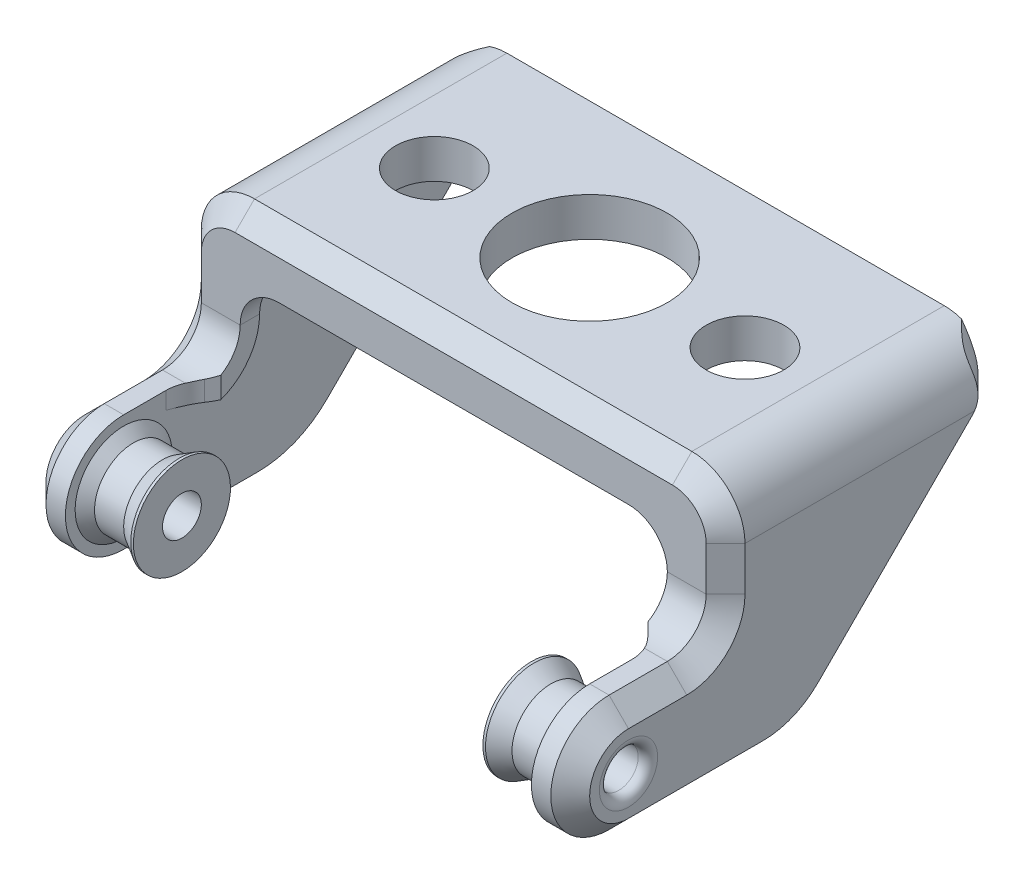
ISO-10303-21;
HEADER;
FILE_DESCRIPTION(('STEP AP214'),'2;1');
FILE_NAME('part.step','',(''),(''),'','','');
FILE_SCHEMA(('AUTOMOTIVE_DESIGN { 1 0 10303 214 1 1 1 1 }'));
ENDSEC;
DATA;
#1=APPLICATION_CONTEXT('core data for automotive mechanical design processes');
#2=APPLICATION_PROTOCOL_DEFINITION('international standard','automotive_design',2000,#1);
#3=PRODUCT_CONTEXT('',#1,'mechanical');
#4=PRODUCT('Part','Part','',(#3));
#5=PRODUCT_RELATED_PRODUCT_CATEGORY('part','',(#4));
#6=PRODUCT_DEFINITION_FORMATION('','',#4);
#7=PRODUCT_DEFINITION_CONTEXT('part definition',#1,'design');
#8=PRODUCT_DEFINITION('design','',#6,#7);
#9=PRODUCT_DEFINITION_SHAPE('','',#8);
#10=(LENGTH_UNIT() NAMED_UNIT(*) SI_UNIT(.MILLI.,.METRE.));
#11=(NAMED_UNIT(*) PLANE_ANGLE_UNIT() SI_UNIT($,.RADIAN.));
#12=(NAMED_UNIT(*) SI_UNIT($,.STERADIAN.) SOLID_ANGLE_UNIT());
#13=UNCERTAINTY_MEASURE_WITH_UNIT(LENGTH_MEASURE(1.E-05),#10,'distance_accuracy_value','');
#14=(GEOMETRIC_REPRESENTATION_CONTEXT(3) GLOBAL_UNCERTAINTY_ASSIGNED_CONTEXT((#13)) GLOBAL_UNIT_ASSIGNED_CONTEXT((#10,
#11,#12)) REPRESENTATION_CONTEXT('',''));
#15=CARTESIAN_POINT('',(0.,0.,0.));
#16=DIRECTION('',(0.,0.,1.));
#17=DIRECTION('',(1.,0.,0.));
#18=AXIS2_PLACEMENT_3D('',#15,#16,#17);
#19=CARTESIAN_POINT('',(9.00000000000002,-9.99999999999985,12.));
#20=DIRECTION('',(-1.,0.,0.));
#21=DIRECTION('',(0.,-1.,0.));
#22=AXIS2_PLACEMENT_3D('',#19,#20,#21);
#23=PLANE('',#22);
#24=CARTESIAN_POINT('',(9.00000000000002,-9.99999999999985,12.));
#25=DIRECTION('',(1.,0.,0.));
#26=DIRECTION('',(0.,1.,0.));
#27=AXIS2_PLACEMENT_3D('',#24,#25,#26);
#28=CIRCLE('',#27,2.5);
#29=CARTESIAN_POINT('',(9.00000000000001,-7.49999999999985,12.));
#30=VERTEX_POINT('',#29);
#31=EDGE_CURVE('E938',#30,#30,#28,.T.);
#32=ORIENTED_EDGE('',*,*,#31,.F.);
#33=EDGE_LOOP('',(#32));
#34=FACE_BOUND('',#33,.T.);
#35=CARTESIAN_POINT('',(9.00000000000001,-10.0000000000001,12.));
#36=DIRECTION('',(-1.,0.,0.));
#37=DIRECTION('',(0.,-1.,0.));
#38=AXIS2_PLACEMENT_3D('',#35,#36,#37);
#39=CIRCLE('',#38,0.999999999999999);
#40=CARTESIAN_POINT('',(9.00000000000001,-11.0000000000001,12.));
#41=VERTEX_POINT('',#40);
#42=EDGE_CURVE('E941',#41,#41,#39,.F.);
#43=ORIENTED_EDGE('',*,*,#42,.T.);
#44=EDGE_LOOP('',(#43));
#45=FACE_BOUND('',#44,.T.);
#46=ADVANCED_FACE('F14',(#34,#45),#23,.T.);
#47=CARTESIAN_POINT('',(-9.00000000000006,-9.99999999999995,12.));
#48=DIRECTION('',(1.,0.,0.));
#49=DIRECTION('',(0.,1.,0.));
#50=AXIS2_PLACEMENT_3D('',#47,#48,#49);
#51=PLANE('',#50);
#52=CARTESIAN_POINT('',(-9.00000000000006,-9.99999999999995,12.));
#53=DIRECTION('',(-1.,0.,0.));
#54=DIRECTION('',(0.,-1.,0.));
#55=AXIS2_PLACEMENT_3D('',#52,#53,#54);
#56=CIRCLE('',#55,2.5);
#57=CARTESIAN_POINT('',(-9.00000000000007,-12.5,12.));
#58=VERTEX_POINT('',#57);
#59=EDGE_CURVE('E934',#58,#58,#56,.T.);
#60=ORIENTED_EDGE('',*,*,#59,.F.);
#61=EDGE_LOOP('',(#60));
#62=FACE_BOUND('',#61,.T.);
#63=CARTESIAN_POINT('',(-9.00000000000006,-9.99999999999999,12.));
#64=DIRECTION('',(-1.,0.,0.));
#65=DIRECTION('',(0.,-1.,0.));
#66=AXIS2_PLACEMENT_3D('',#63,#64,#65);
#67=CIRCLE('',#66,0.999999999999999);
#68=CARTESIAN_POINT('',(-9.00000000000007,-11.,12.));
#69=VERTEX_POINT('',#68);
#70=EDGE_CURVE('E943',#69,#69,#67,.T.);
#71=ORIENTED_EDGE('',*,*,#70,.T.);
#72=EDGE_LOOP('',(#71));
#73=FACE_BOUND('',#72,.T.);
#74=ADVANCED_FACE('F947',(#62,#73),#51,.T.);
#75=CARTESIAN_POINT('',(16.8284271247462,-10.0000000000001,12.));
#76=DIRECTION('',(-1.,0.,0.));
#77=DIRECTION('',(0.,-1.,0.));
#78=AXIS2_PLACEMENT_3D('',#75,#76,#77);
#79=CYLINDRICAL_SURFACE('',#78,0.999999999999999);
#80=ORIENTED_EDGE('',*,*,#70,.F.);
#81=EDGE_LOOP('',(#80));
#82=FACE_BOUND('',#81,.T.);
#83=CARTESIAN_POINT('',(-13.5000000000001,-9.99999999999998,12.));
#84=DIRECTION('',(1.,0.,0.));
#85=DIRECTION('',(0.,1.,0.));
#86=AXIS2_PLACEMENT_3D('',#83,#84,#85);
#87=CIRCLE('',#86,0.999999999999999);
#88=CARTESIAN_POINT('',(-13.5000000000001,-8.99999999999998,12.));
#89=VERTEX_POINT('',#88);
#90=EDGE_CURVE('E937',#89,#89,#87,.T.);
#91=ORIENTED_EDGE('',*,*,#90,.F.);
#92=EDGE_LOOP('',(#91));
#93=FACE_BOUND('',#92,.T.);
#94=ADVANCED_FACE('F949',(#82,#93),#79,.F.);
#95=CARTESIAN_POINT('',(16.8284271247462,-10.0000000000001,12.));
#96=DIRECTION('',(-1.,0.,0.));
#97=DIRECTION('',(0.,-1.,0.));
#98=AXIS2_PLACEMENT_3D('',#95,#96,#97);
#99=CYLINDRICAL_SURFACE('',#98,0.999999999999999);
#100=CARTESIAN_POINT('',(13.5,-10.0000000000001,12.));
#101=DIRECTION('',(-1.,0.,0.));
#102=DIRECTION('',(0.,-1.,0.));
#103=AXIS2_PLACEMENT_3D('',#100,#101,#102);
#104=CIRCLE('',#103,0.999999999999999);
#105=CARTESIAN_POINT('',(13.5,-11.0000000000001,12.));
#106=VERTEX_POINT('',#105);
#107=EDGE_CURVE('E956',#106,#106,#104,.T.);
#108=ORIENTED_EDGE('',*,*,#107,.F.);
#109=EDGE_LOOP('',(#108));
#110=FACE_BOUND('',#109,.T.);
#111=ORIENTED_EDGE('',*,*,#42,.F.);
#112=EDGE_LOOP('',(#111));
#113=FACE_BOUND('',#112,.T.);
#114=ADVANCED_FACE('F952',(#110,#113),#99,.F.);
#115=CARTESIAN_POINT('',(9.00000000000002,-9.99999999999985,12.));
#116=DIRECTION('',(1.,0.,0.));
#117=DIRECTION('',(0.,1.,0.));
#118=AXIS2_PLACEMENT_3D('',#115,#116,#117);
#119=CYLINDRICAL_SURFACE('',#118,2.5);
#120=ORIENTED_EDGE('',*,*,#31,.T.);
#121=EDGE_LOOP('',(#120));
#122=FACE_BOUND('',#121,.T.);
#123=CARTESIAN_POINT('',(9.1339745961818,-9.99999999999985,12.));
#124=DIRECTION('',(-1.,0.,0.));
#125=DIRECTION('',(0.,-1.,0.));
#126=AXIS2_PLACEMENT_3D('',#123,#124,#125);
#127=CIRCLE('',#126,2.50000000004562);
#128=CARTESIAN_POINT('',(9.13397459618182,-12.5000000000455,12.));
#129=VERTEX_POINT('',#128);
#130=EDGE_CURVE('E959',#129,#129,#127,.F.);
#131=ORIENTED_EDGE('',*,*,#130,.F.);
#132=EDGE_LOOP('',(#131));
#133=FACE_BOUND('',#132,.T.);
#134=ADVANCED_FACE('F1195',(#122,#133),#119,.T.);
#135=CARTESIAN_POINT('',(-9.00000000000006,-9.99999999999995,12.));
#136=DIRECTION('',(-1.,0.,0.));
#137=DIRECTION('',(0.,-1.,0.));
#138=AXIS2_PLACEMENT_3D('',#135,#136,#137);
#139=CYLINDRICAL_SURFACE('',#138,2.5);
#140=ORIENTED_EDGE('',*,*,#59,.T.);
#141=EDGE_LOOP('',(#140));
#142=FACE_BOUND('',#141,.T.);
#143=CARTESIAN_POINT('',(-9.13397459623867,-9.99999999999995,12.));
#144=DIRECTION('',(1.,0.,0.));
#145=DIRECTION('',(0.,1.,0.));
#146=AXIS2_PLACEMENT_3D('',#143,#144,#145);
#147=CIRCLE('',#146,2.50000000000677);
#148=CARTESIAN_POINT('',(-9.13397459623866,-7.49999999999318,12.));
#149=VERTEX_POINT('',#148);
#150=EDGE_CURVE('E880',#149,#149,#147,.F.);
#151=ORIENTED_EDGE('',*,*,#150,.F.);
#152=EDGE_LOOP('',(#151));
#153=FACE_BOUND('',#152,.T.);
#154=ADVANCED_FACE('F1209',(#142,#153),#139,.T.);
#155=CARTESIAN_POINT('',(-13.5000000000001,-9.99999999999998,12.));
#156=DIRECTION('',(1.,0.,0.));
#157=DIRECTION('',(0.,1.,0.));
#158=AXIS2_PLACEMENT_3D('',#155,#156,#157);
#159=TOROIDAL_SURFACE('',#158,1.5,0.5);
#160=CARTESIAN_POINT('',(-14.0000000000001,-9.99999999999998,12.));
#161=DIRECTION('',(-1.,0.,0.));
#162=DIRECTION('',(0.,1.,0.));
#163=AXIS2_PLACEMENT_3D('',#160,#161,#162);
#164=CIRCLE('',#163,1.5);
#165=CARTESIAN_POINT('',(-14.0000000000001,-8.49999999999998,12.));
#166=VERTEX_POINT('',#165);
#167=CARTESIAN_POINT('',(-14.0000000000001,-11.5,12.));
#168=VERTEX_POINT('',#167);
#169=EDGE_CURVE('E849',#166,#168,#164,.T.);
#170=ORIENTED_EDGE('',*,*,#169,.T.);
#171=CARTESIAN_POINT('',(-14.0000000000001,-9.99999999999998,12.));
#172=DIRECTION('',(-1.,0.,0.));
#173=DIRECTION('',(0.,-1.,0.));
#174=AXIS2_PLACEMENT_3D('',#171,#172,#173);
#175=CIRCLE('',#174,1.5);
#176=EDGE_CURVE('E860',#168,#166,#175,.T.);
#177=ORIENTED_EDGE('',*,*,#176,.T.);
#178=EDGE_LOOP('',(#170,#177));
#179=FACE_BOUND('',#178,.T.);
#180=ORIENTED_EDGE('',*,*,#90,.T.);
#181=EDGE_LOOP('',(#180));
#182=FACE_BOUND('',#181,.T.);
#183=ADVANCED_FACE('F903',(#179,#182),#159,.T.);
#184=CARTESIAN_POINT('',(13.5,-10.0000000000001,12.));
#185=DIRECTION('',(-1.,0.,0.));
#186=DIRECTION('',(0.,-1.,0.));
#187=AXIS2_PLACEMENT_3D('',#184,#185,#186);
#188=TOROIDAL_SURFACE('',#187,1.5,0.5);
#189=CARTESIAN_POINT('',(14.,-10.0000000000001,12.));
#190=DIRECTION('',(1.,0.,0.));
#191=DIRECTION('',(0.,-1.,0.));
#192=AXIS2_PLACEMENT_3D('',#189,#190,#191);
#193=CIRCLE('',#192,1.5);
#194=CARTESIAN_POINT('',(14.,-11.5000000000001,12.));
#195=VERTEX_POINT('',#194);
#196=CARTESIAN_POINT('',(14.,-8.50000000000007,12.));
#197=VERTEX_POINT('',#196);
#198=EDGE_CURVE('E814',#195,#197,#193,.T.);
#199=ORIENTED_EDGE('',*,*,#198,.T.);
#200=CARTESIAN_POINT('',(14.,-10.0000000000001,12.));
#201=DIRECTION('',(1.,0.,0.));
#202=DIRECTION('',(0.,1.,0.));
#203=AXIS2_PLACEMENT_3D('',#200,#201,#202);
#204=CIRCLE('',#203,1.5);
#205=EDGE_CURVE('E929',#197,#195,#204,.T.);
#206=ORIENTED_EDGE('',*,*,#205,.T.);
#207=EDGE_LOOP('',(#199,#206));
#208=FACE_BOUND('',#207,.T.);
#209=ORIENTED_EDGE('',*,*,#107,.T.);
#210=EDGE_LOOP('',(#209));
#211=FACE_BOUND('',#210,.T.);
#212=ADVANCED_FACE('F898',(#208,#211),#188,.T.);
#213=CARTESIAN_POINT('',(9.1339745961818,-9.99999999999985,12.));
#214=DIRECTION('',(-1.,0.,0.));
#215=DIRECTION('',(0.,-1.,0.));
#216=AXIS2_PLACEMENT_3D('',#213,#214,#215);
#217=CONICAL_SURFACE('',#216,2.50000000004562,0.523598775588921);
#218=CARTESIAN_POINT('',(10.,-10.,12.));
#219=DIRECTION('',(1.,0.,0.));
#220=DIRECTION('',(0.,1.,0.));
#221=AXIS2_PLACEMENT_3D('',#218,#219,#220);
#222=CIRCLE('',#221,2.);
#223=CARTESIAN_POINT('',(10.,-8.00000000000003,12.));
#224=VERTEX_POINT('',#223);
#225=EDGE_CURVE('E804',#224,#224,#222,.T.);
#226=ORIENTED_EDGE('',*,*,#225,.F.);
#227=EDGE_LOOP('',(#226));
#228=FACE_BOUND('',#227,.T.);
#229=ORIENTED_EDGE('',*,*,#130,.T.);
#230=EDGE_LOOP('',(#229));
#231=FACE_BOUND('',#230,.T.);
#232=ADVANCED_FACE('F902',(#228,#231),#217,.T.);
#233=CARTESIAN_POINT('',(-9.13397459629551,-9.99999999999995,12.));
#234=DIRECTION('',(1.,0.,0.));
#235=DIRECTION('',(0.,1.,0.));
#236=AXIS2_PLACEMENT_3D('',#233,#234,#235);
#237=CONICAL_SURFACE('',#236,2.49999999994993,0.52359877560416);
#238=CARTESIAN_POINT('',(-10.0000000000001,-9.99999999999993,12.));
#239=DIRECTION('',(-1.,0.,0.));
#240=DIRECTION('',(0.,-1.,0.));
#241=AXIS2_PLACEMENT_3D('',#238,#239,#240);
#242=CIRCLE('',#241,2.);
#243=CARTESIAN_POINT('',(-10.0000000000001,-11.9999999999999,12.));
#244=VERTEX_POINT('',#243);
#245=EDGE_CURVE('E738',#244,#244,#242,.T.);
#246=ORIENTED_EDGE('',*,*,#245,.F.);
#247=EDGE_LOOP('',(#246));
#248=FACE_BOUND('',#247,.T.);
#249=ORIENTED_EDGE('',*,*,#150,.T.);
#250=EDGE_LOOP('',(#249));
#251=FACE_BOUND('',#250,.T.);
#252=ADVANCED_FACE('F1227',(#248,#251),#237,.T.);
#253=CARTESIAN_POINT('',(14.0000000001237,-5.00000000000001,9.));
#254=DIRECTION('',(1.,0.,0.));
#255=DIRECTION('',(0.,1.,0.));
#256=AXIS2_PLACEMENT_3D('',#253,#254,#255);
#257=CONICAL_SURFACE('',#256,3.00000000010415,0.785398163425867);
#258=CARTESIAN_POINT('',(12.9999999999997,-5.00000000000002,9.));
#259=DIRECTION('',(-1.,0.,0.));
#260=DIRECTION('',(0.,-1.,0.));
#261=AXIS2_PLACEMENT_3D('',#258,#259,#260);
#262=CIRCLE('',#261,2.);
#263=CARTESIAN_POINT('',(13.0000000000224,-5.00000000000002,6.99999999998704));
#264=VERTEX_POINT('',#263);
#265=CARTESIAN_POINT('',(12.9999999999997,-7.00000000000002,9.));
#266=VERTEX_POINT('',#265);
#267=EDGE_CURVE('E667',#264,#266,#262,.T.);
#268=ORIENTED_EDGE('',*,*,#267,.T.);
#269=DIRECTION('',(-0.707106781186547,0.707106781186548,0.));
#270=VECTOR('',#269,1.);
#271=CARTESIAN_POINT('',(14.,-8.00000000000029,9.00000000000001));
#272=LINE('',#271,#270);
#273=CARTESIAN_POINT('',(14.000000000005,-8.0000000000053,9.00000000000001));
#274=VERTEX_POINT('',#273);
#275=EDGE_CURVE('E801',#274,#266,#272,.T.);
#276=ORIENTED_EDGE('',*,*,#275,.F.);
#277=CARTESIAN_POINT('',(14.00000000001,-5.00000000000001,9.));
#278=DIRECTION('',(1.,0.,0.));
#279=DIRECTION('',(0.,1.,0.));
#280=AXIS2_PLACEMENT_3D('',#277,#278,#279);
#281=CIRCLE('',#280,2.99999999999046);
#282=CARTESIAN_POINT('',(14.0000000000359,-5.00000000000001,5.99999999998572));
#283=VERTEX_POINT('',#282);
#284=EDGE_CURVE('E932',#274,#283,#281,.T.);
#285=ORIENTED_EDGE('',*,*,#284,.T.);
#286=DIRECTION('',(-0.707106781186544,0.,0.707106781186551));
#287=VECTOR('',#286,1.);
#288=CARTESIAN_POINT('',(499000.000000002,-4.99999999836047,-498980.000000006));
#289=LINE('',#288,#287);
#290=EDGE_CURVE('E878',#264,#283,#289,.F.);
#291=ORIENTED_EDGE('',*,*,#290,.F.);
#292=EDGE_LOOP('',(#268,#276,#285,#291));
#293=FACE_BOUND('',#292,.T.);
#294=ADVANCED_FACE('F1255',(#293),#257,.F.);
#295=CARTESIAN_POINT('',(-14.00000000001,-5.00000000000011,9.00000000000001));
#296=DIRECTION('',(-1.,0.,0.));
#297=DIRECTION('',(0.,-1.,0.));
#298=AXIS2_PLACEMENT_3D('',#295,#296,#297);
#299=CONICAL_SURFACE('',#298,2.99999999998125,0.785398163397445);
#300=CARTESIAN_POINT('',(-12.9999999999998,-5.00000000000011,9.));
#301=DIRECTION('',(-1.,0.,0.));
#302=DIRECTION('',(0.,-1.,0.));
#303=AXIS2_PLACEMENT_3D('',#300,#301,#302);
#304=CIRCLE('',#303,2.);
#305=CARTESIAN_POINT('',(-12.9999999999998,-7.00000000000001,9.));
#306=VERTEX_POINT('',#305);
#307=CARTESIAN_POINT('',(-12.9999999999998,-5.00000000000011,7.));
#308=VERTEX_POINT('',#307);
#309=EDGE_CURVE('E647',#306,#308,#304,.F.);
#310=ORIENTED_EDGE('',*,*,#309,.T.);
#311=DIRECTION('',(0.707106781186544,0.,0.707106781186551));
#312=VECTOR('',#311,1.);
#313=CARTESIAN_POINT('',(-12.9999999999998,-5.0000000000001,7.00000000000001));
#314=LINE('',#313,#312);
#315=CARTESIAN_POINT('',(-14.000000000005,-5.0000000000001,5.99999999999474));
#316=VERTEX_POINT('',#315);
#317=EDGE_CURVE('E655',#316,#308,#314,.T.);
#318=ORIENTED_EDGE('',*,*,#317,.F.);
#319=CARTESIAN_POINT('',(-14.00000000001,-5.00000000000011,9.00000000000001));
#320=DIRECTION('',(-1.,0.,0.));
#321=DIRECTION('',(0.,-1.,0.));
#322=AXIS2_PLACEMENT_3D('',#319,#320,#321);
#323=CIRCLE('',#322,2.99999999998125);
#324=CARTESIAN_POINT('',(-14.000000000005,-8.00000000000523,9.));
#325=VERTEX_POINT('',#324);
#326=EDGE_CURVE('E261',#316,#325,#323,.T.);
#327=ORIENTED_EDGE('',*,*,#326,.T.);
#328=DIRECTION('',(-0.707106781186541,-0.707106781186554,0.));
#329=VECTOR('',#328,1.);
#330=CARTESIAN_POINT('',(-14.0000000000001,-8.00000000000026,9.));
#331=LINE('',#330,#329);
#332=EDGE_CURVE('E735',#306,#325,#331,.T.);
#333=ORIENTED_EDGE('',*,*,#332,.F.);
#334=EDGE_LOOP('',(#310,#318,#327,#333));
#335=FACE_BOUND('',#334,.T.);
#336=ADVANCED_FACE('F1262',(#335),#299,.F.);
#337=CARTESIAN_POINT('',(-14.,0.,0.));
#338=DIRECTION('',(1.,0.,0.));
#339=DIRECTION('',(0.,1.,0.));
#340=AXIS2_PLACEMENT_3D('',#337,#338,#339);
#341=PLANE('',#340);
#342=CARTESIAN_POINT('',(-14.00000000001,-2.17157287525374,-5.));
#343=DIRECTION('',(1.,0.,0.));
#344=DIRECTION('',(0.,1.,0.));
#345=AXIS2_PLACEMENT_3D('',#342,#343,#344);
#346=CIRCLE('',#345,1.00000000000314);
#347=CARTESIAN_POINT('',(-14.00000000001,-2.87867965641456,-5.70710678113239));
#348=VERTEX_POINT('',#347);
#349=CARTESIAN_POINT('',(-14.000000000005,-2.73660000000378,-5.82507232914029));
#350=VERTEX_POINT('',#349);
#351=EDGE_CURVE('E681',#348,#350,#346,.T.);
#352=ORIENTED_EDGE('',*,*,#351,.F.);
#353=DIRECTION('',(0.,-0.707106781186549,0.707106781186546));
#354=VECTOR('',#353,1.);
#355=CARTESIAN_POINT('',(-14.,-2.87867965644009,-5.70710678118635));
#356=LINE('',#355,#354);
#357=CARTESIAN_POINT('',(-14.0000000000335,-10.8284271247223,2.2426406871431));
#358=VERTEX_POINT('',#357);
#359=EDGE_CURVE('E698',#348,#358,#356,.T.);
#360=ORIENTED_EDGE('',*,*,#359,.T.);
#361=CARTESIAN_POINT('',(-14.0000000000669,-7.99999999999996,5.07106781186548));
#362=DIRECTION('',(1.,0.,0.));
#363=DIRECTION('',(0.,1.,0.));
#364=AXIS2_PLACEMENT_3D('',#361,#362,#363);
#365=CIRCLE('',#364,4.00000000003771);
#366=CARTESIAN_POINT('',(-14.0000000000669,-12.0000000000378,5.07106781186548));
#367=VERTEX_POINT('',#366);
#368=EDGE_CURVE('E704',#367,#358,#365,.T.);
#369=ORIENTED_EDGE('',*,*,#368,.F.);
#370=DIRECTION('',(0.,0.,1.));
#371=VECTOR('',#370,1.);
#372=CARTESIAN_POINT('',(-14.,-11.9999999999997,-7.));
#373=LINE('',#372,#371);
#374=CARTESIAN_POINT('',(-14.000000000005,-11.9999999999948,12.));
#375=VERTEX_POINT('',#374);
#376=EDGE_CURVE('E705',#375,#367,#373,.F.);
#377=ORIENTED_EDGE('',*,*,#376,.F.);
#378=CARTESIAN_POINT('',(-14.00000000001,-9.99999999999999,12.));
#379=DIRECTION('',(1.,0.,0.));
#380=DIRECTION('',(0.,1.,0.));
#381=AXIS2_PLACEMENT_3D('',#378,#379,#380);
#382=CIRCLE('',#381,2.00000000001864);
#383=CARTESIAN_POINT('',(-14.0000000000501,-8.00000000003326,12.));
#384=VERTEX_POINT('',#383);
#385=EDGE_CURVE('E716',#384,#375,#382,.T.);
#386=ORIENTED_EDGE('',*,*,#385,.F.);
#387=DIRECTION('',(0.,0.,1.));
#388=VECTOR('',#387,1.);
#389=CARTESIAN_POINT('',(-14.0000000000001,-8.00000000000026,0.));
#390=LINE('',#389,#388);
#391=EDGE_CURVE('E727',#325,#384,#390,.T.);
#392=ORIENTED_EDGE('',*,*,#391,.F.);
#393=ORIENTED_EDGE('',*,*,#326,.F.);
#394=DIRECTION('',(0.,1.,0.));
#395=VECTOR('',#394,1.);
#396=CARTESIAN_POINT('',(-14.,-2.,5.99999999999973));
#397=LINE('',#396,#395);
#398=CARTESIAN_POINT('',(-14.,-2.73659999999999,5.99999999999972));
#399=VERTEX_POINT('',#398);
#400=EDGE_CURVE('E651',#399,#316,#397,.F.);
#401=ORIENTED_EDGE('',*,*,#400,.F.);
#402=DIRECTION('',(0.,0.,-1.));
#403=VECTOR('',#402,1.);
#404=CARTESIAN_POINT('',(-14.,-2.7366,14.4415073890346));
#405=LINE('',#404,#403);
#406=EDGE_CURVE('E635',#350,#399,#405,.F.);
#407=ORIENTED_EDGE('',*,*,#406,.F.);
#408=EDGE_LOOP('',(#352,#360,#369,#377,#386,#392,#393,#401,#407));
#409=FACE_BOUND('',#408,.T.);
#410=ORIENTED_EDGE('',*,*,#169,.F.);
#411=ORIENTED_EDGE('',*,*,#176,.F.);
#412=EDGE_LOOP('',(#410,#411));
#413=FACE_BOUND('',#412,.T.);
#414=ADVANCED_FACE('F832',(#409,#413),#341,.F.);
#415=CARTESIAN_POINT('',(14.,0.,0.));
#416=DIRECTION('',(-1.,0.,0.));
#417=DIRECTION('',(0.,-1.,0.));
#418=AXIS2_PLACEMENT_3D('',#415,#416,#417);
#419=PLANE('',#418);
#420=CARTESIAN_POINT('',(13.9999999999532,-2.17157287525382,-5.));
#421=DIRECTION('',(-1.,0.,0.));
#422=DIRECTION('',(0.,-1.,0.));
#423=AXIS2_PLACEMENT_3D('',#420,#421,#422);
#424=CIRCLE('',#423,1.00000000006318);
#425=CARTESIAN_POINT('',(13.9999999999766,-2.7366,-5.82507232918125));
#426=VERTEX_POINT('',#425);
#427=CARTESIAN_POINT('',(13.9999999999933,-2.87867965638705,-5.70710678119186));
#428=VERTEX_POINT('',#427);
#429=EDGE_CURVE('E893',#426,#428,#424,.T.);
#430=ORIENTED_EDGE('',*,*,#429,.F.);
#431=DIRECTION('',(0.,0.,1.));
#432=VECTOR('',#431,1.);
#433=CARTESIAN_POINT('',(14.,-2.7366,-14.4389098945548));
#434=LINE('',#433,#432);
#435=CARTESIAN_POINT('',(13.9999999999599,-2.73660000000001,6.00000000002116));
#436=VERTEX_POINT('',#435);
#437=EDGE_CURVE('E605',#436,#426,#434,.F.);
#438=ORIENTED_EDGE('',*,*,#437,.F.);
#439=DIRECTION('',(0.,1.,0.));
#440=VECTOR('',#439,1.);
#441=CARTESIAN_POINT('',(14.,0.,5.99999999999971));
#442=LINE('',#441,#440);
#443=EDGE_CURVE('E664',#283,#436,#442,.T.);
#444=ORIENTED_EDGE('',*,*,#443,.F.);
#445=ORIENTED_EDGE('',*,*,#284,.F.);
#446=DIRECTION('',(0.,0.,1.));
#447=VECTOR('',#446,1.);
#448=CARTESIAN_POINT('',(14.,-8.00000000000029,0.));
#449=LINE('',#448,#447);
#450=CARTESIAN_POINT('',(14.0000000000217,-8.00000000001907,12.));
#451=VERTEX_POINT('',#450);
#452=EDGE_CURVE('E803',#451,#274,#449,.F.);
#453=ORIENTED_EDGE('',*,*,#452,.F.);
#454=CARTESIAN_POINT('',(14.00000000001,-10.,12.));
#455=DIRECTION('',(-1.,0.,0.));
#456=DIRECTION('',(0.,-1.,0.));
#457=AXIS2_PLACEMENT_3D('',#454,#455,#456);
#458=CIRCLE('',#457,2.00000000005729);
#459=CARTESIAN_POINT('',(14.0000000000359,-11.9999999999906,12.));
#460=VERTEX_POINT('',#459);
#461=EDGE_CURVE('E763',#460,#451,#458,.T.);
#462=ORIENTED_EDGE('',*,*,#461,.F.);
#463=DIRECTION('',(0.,0.,1.));
#464=VECTOR('',#463,1.);
#465=CARTESIAN_POINT('',(14.,-11.9999999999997,0.));
#466=LINE('',#465,#464);
#467=CARTESIAN_POINT('',(14.000000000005,-11.9999999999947,5.07106781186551));
#468=VERTEX_POINT('',#467);
#469=EDGE_CURVE('E779',#460,#468,#466,.F.);
#470=ORIENTED_EDGE('',*,*,#469,.T.);
#471=CARTESIAN_POINT('',(14.00000000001,-8.00000000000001,5.07106781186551));
#472=DIRECTION('',(-1.,0.,0.));
#473=DIRECTION('',(0.,-1.,0.));
#474=AXIS2_PLACEMENT_3D('',#471,#472,#473);
#475=CIRCLE('',#474,4.00000000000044);
#476=CARTESIAN_POINT('',(13.9999999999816,-10.8284271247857,2.24264068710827));
#477=VERTEX_POINT('',#476);
#478=EDGE_CURVE('E785',#477,#468,#475,.T.);
#479=ORIENTED_EDGE('',*,*,#478,.F.);
#480=DIRECTION('',(0.,0.707106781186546,-0.707106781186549));
#481=VECTOR('',#480,1.);
#482=CARTESIAN_POINT('',(14.,-10.828427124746,2.24264068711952));
#483=LINE('',#482,#481);
#484=EDGE_CURVE('E786',#477,#428,#483,.T.);
#485=ORIENTED_EDGE('',*,*,#484,.T.);
#486=EDGE_LOOP('',(#430,#438,#444,#445,#453,#462,#470,#479,#485));
#487=FACE_BOUND('',#486,.T.);
#488=ORIENTED_EDGE('',*,*,#198,.F.);
#489=ORIENTED_EDGE('',*,*,#205,.F.);
#490=EDGE_LOOP('',(#488,#489));
#491=FACE_BOUND('',#490,.T.);
#492=ADVANCED_FACE('F821',(#487,#491),#419,.F.);
#493=CARTESIAN_POINT('',(10.,-10.,12.));
#494=DIRECTION('',(1.,0.,0.));
#495=DIRECTION('',(0.,1.,0.));
#496=AXIS2_PLACEMENT_3D('',#493,#494,#495);
#497=CYLINDRICAL_SURFACE('',#496,2.);
#498=ORIENTED_EDGE('',*,*,#225,.T.);
#499=EDGE_LOOP('',(#498));
#500=FACE_BOUND('',#499,.T.);
#501=CARTESIAN_POINT('',(11.5000000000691,-10.,12.));
#502=DIRECTION('',(1.,0.,0.));
#503=DIRECTION('',(0.,1.,0.));
#504=AXIS2_PLACEMENT_3D('',#501,#502,#503);
#505=CIRCLE('',#504,2.00000000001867);
#506=CARTESIAN_POINT('',(11.5000000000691,-7.99999999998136,12.));
#507=VERTEX_POINT('',#506);
#508=EDGE_CURVE('E746',#507,#507,#505,.T.);
#509=ORIENTED_EDGE('',*,*,#508,.F.);
#510=EDGE_LOOP('',(#509));
#511=FACE_BOUND('',#510,.T.);
#512=ADVANCED_FACE('F831',(#500,#511),#497,.T.);
#513=CARTESIAN_POINT('',(14.,-8.00000000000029,0.));
#514=DIRECTION('',(0.707106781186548,0.707106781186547,0.));
#515=DIRECTION('',(-0.707106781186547,0.707106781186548,0.));
#516=AXIS2_PLACEMENT_3D('',#513,#514,#515);
#517=PLANE('',#516);
#518=DIRECTION('',(0.707106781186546,-0.707106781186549,0.));
#519=VECTOR('',#518,1.);
#520=CARTESIAN_POINT('',(-498973.999999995,498979.999999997,12.0000000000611));
#521=LINE('',#520,#519);
#522=CARTESIAN_POINT('',(13.0000000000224,-7.00000000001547,12.));
#523=VERTEX_POINT('',#522);
#524=EDGE_CURVE('E755',#451,#523,#521,.F.);
#525=ORIENTED_EDGE('',*,*,#524,.F.);
#526=ORIENTED_EDGE('',*,*,#452,.T.);
#527=ORIENTED_EDGE('',*,*,#275,.T.);
#528=DIRECTION('',(0.,0.,1.));
#529=VECTOR('',#528,1.);
#530=CARTESIAN_POINT('',(12.9999999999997,-7.00000000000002,7.));
#531=LINE('',#530,#529);
#532=EDGE_CURVE('E597',#523,#266,#531,.F.);
#533=ORIENTED_EDGE('',*,*,#532,.F.);
#534=EDGE_LOOP('',(#525,#526,#527,#533));
#535=FACE_BOUND('',#534,.T.);
#536=ADVANCED_FACE('F1283',(#535),#517,.T.);
#537=CARTESIAN_POINT('',(11.,-8.00000000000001,8.));
#538=DIRECTION('',(0.707106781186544,0.,-0.707106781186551));
#539=DIRECTION('',(-0.707106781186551,0.,-0.707106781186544));
#540=AXIS2_PLACEMENT_3D('',#537,#538,#539);
#541=PLANE('',#540);
#542=DIRECTION('',(0.,1.,0.));
#543=VECTOR('',#542,1.);
#544=CARTESIAN_POINT('',(11.4142135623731,-8.,8.41421356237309));
#545=LINE('',#544,#543);
#546=CARTESIAN_POINT('',(11.4142135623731,-7.94225326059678,8.41421356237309));
#547=VERTEX_POINT('',#546);
#548=CARTESIAN_POINT('',(11.4142135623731,-6.91229031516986,8.41421356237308));
#549=VERTEX_POINT('',#548);
#550=EDGE_CURVE('E558',#547,#549,#545,.T.);
#551=ORIENTED_EDGE('',*,*,#550,.T.);
#552=CARTESIAN_POINT('',(12.,-5.00000000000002,9.));
#553=DIRECTION('',(0.707106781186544,0.,-0.707106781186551));
#554=DIRECTION('',(-0.707106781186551,0.,-0.707106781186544));
#555=AXIS2_PLACEMENT_3D('',#552,#553,#554);
#556=ELLIPSE('',#555,2.8284271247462,2.);
#557=CARTESIAN_POINT('',(11.,-6.7320508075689,8.));
#558=VERTEX_POINT('',#557);
#559=EDGE_CURVE('E670',#549,#558,#556,.T.);
#560=ORIENTED_EDGE('',*,*,#559,.T.);
#561=DIRECTION('',(0.,1.,0.));
#562=VECTOR('',#561,1.);
#563=CARTESIAN_POINT('',(11.,-8.00000000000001,8.));
#564=LINE('',#563,#562);
#565=CARTESIAN_POINT('',(11.,-7.8284271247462,8.00000000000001));
#566=VERTEX_POINT('',#565);
#567=EDGE_CURVE('E798',#558,#566,#564,.F.);
#568=ORIENTED_EDGE('',*,*,#567,.T.);
#569=CARTESIAN_POINT('',(12.,-5.00000000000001,9.));
#570=DIRECTION('',(0.707106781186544,0.,-0.707106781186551));
#571=DIRECTION('',(-0.707106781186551,0.,-0.707106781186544));
#572=AXIS2_PLACEMENT_3D('',#569,#570,#571);
#573=ELLIPSE('',#572,4.24264068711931,3.);
#574=EDGE_CURVE('E575',#547,#566,#573,.T.);
#575=ORIENTED_EDGE('',*,*,#574,.F.);
#576=EDGE_LOOP('',(#551,#560,#568,#575));
#577=FACE_BOUND('',#576,.T.);
#578=ADVANCED_FACE('F1176',(#577),#541,.F.);
#579=CARTESIAN_POINT('',(11.,-8.00000000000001,31.561028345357));
#580=DIRECTION('',(1.,0.,0.));
#581=DIRECTION('',(0.,0.,-1.));
#582=AXIS2_PLACEMENT_3D('',#579,#580,#581);
#583=PLANE('',#582);
#584=ORIENTED_EDGE('',*,*,#567,.F.);
#585=CARTESIAN_POINT('',(11.,-5.00000000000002,9.));
#586=DIRECTION('',(-1.,0.,0.));
#587=DIRECTION('',(0.,-1.,0.));
#588=AXIS2_PLACEMENT_3D('',#585,#586,#587);
#589=CIRCLE('',#588,2.);
#590=CARTESIAN_POINT('',(11.,-4.99999999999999,7.));
#591=VERTEX_POINT('',#590);
#592=EDGE_CURVE('E875',#558,#591,#589,.F.);
#593=ORIENTED_EDGE('',*,*,#592,.T.);
#594=DIRECTION('',(0.,0.,-1.));
#595=VECTOR('',#594,1.);
#596=CARTESIAN_POINT('',(11.,-4.99999999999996,31.561028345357));
#597=LINE('',#596,#595);
#598=CARTESIAN_POINT('',(11.,-4.99999999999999,6.));
#599=VERTEX_POINT('',#598);
#600=EDGE_CURVE('E800',#599,#591,#597,.F.);
#601=ORIENTED_EDGE('',*,*,#600,.F.);
#602=CARTESIAN_POINT('',(11.,-5.,9.));
#603=DIRECTION('',(-1.,0.,0.));
#604=DIRECTION('',(0.,-1.,0.));
#605=AXIS2_PLACEMENT_3D('',#602,#603,#604);
#606=CIRCLE('',#605,3.);
#607=EDGE_CURVE('E518',#566,#599,#606,.F.);
#608=ORIENTED_EDGE('',*,*,#607,.F.);
#609=EDGE_LOOP('',(#584,#593,#601,#608));
#610=FACE_BOUND('',#609,.T.);
#611=ADVANCED_FACE('F1180',(#610),#583,.F.);
#612=CARTESIAN_POINT('',(14.,-4.29289321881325,-4.29289321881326));
#613=DIRECTION('',(-0.707106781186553,0.499999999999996,0.499999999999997));
#614=DIRECTION('',(0.577350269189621,0.,0.81649658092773));
#615=AXIS2_PLACEMENT_3D('',#612,#613,#614);
#616=PLANE('',#615);
#617=DIRECTION('',(0.,-0.707106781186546,0.707106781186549));
#618=VECTOR('',#617,1.);
#619=CARTESIAN_POINT('',(12.9999999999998,-3.00000000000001,-7.));
#620=LINE('',#619,#618);
#621=CARTESIAN_POINT('',(12.999999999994,-11.5355339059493,1.53553390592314));
#622=VERTEX_POINT('',#621);
#623=CARTESIAN_POINT('',(13.0000000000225,-3.58578643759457,-6.41421356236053));
#624=VERTEX_POINT('',#623);
#625=EDGE_CURVE('E587',#622,#624,#620,.F.);
#626=ORIENTED_EDGE('',*,*,#625,.T.);
#627=DIRECTION('',(0.707106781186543,0.500000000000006,0.500000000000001));
#628=VECTOR('',#627,1.);
#629=CARTESIAN_POINT('',(-498982.828427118,-352846.919851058,-352849.748278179));
#630=LINE('',#629,#628);
#631=EDGE_CURVE('E615',#428,#624,#630,.F.);
#632=ORIENTED_EDGE('',*,*,#631,.F.);
#633=ORIENTED_EDGE('',*,*,#484,.F.);
#634=DIRECTION('',(0.707106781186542,0.500000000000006,0.500000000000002));
#635=VECTOR('',#634,1.);
#636=CARTESIAN_POINT('',(-498973.999999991,-352848.626957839,-352835.555890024));
#637=LINE('',#636,#635);
#638=EDGE_CURVE('E782',#622,#477,#637,.T.);
#639=ORIENTED_EDGE('',*,*,#638,.F.);
#640=EDGE_LOOP('',(#626,#632,#633,#639));
#641=FACE_BOUND('',#640,.T.);
#642=ADVANCED_FACE('F1302',(#641),#616,.F.);
#643=CARTESIAN_POINT('',(12.9999999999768,-8.00000000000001,5.07106781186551));
#644=DIRECTION('',(-1.,0.,0.));
#645=DIRECTION('',(0.,-1.,0.));
#646=AXIS2_PLACEMENT_3D('',#643,#644,#645);
#647=CONICAL_SURFACE('',#646,5.00000000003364,0.785398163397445);
#648=ORIENTED_EDGE('',*,*,#638,.T.);
#649=ORIENTED_EDGE('',*,*,#478,.T.);
#650=DIRECTION('',(-0.707106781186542,-0.707106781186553,0.));
#651=VECTOR('',#650,1.);
#652=CARTESIAN_POINT('',(14.,-11.9999999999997,5.07106781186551));
#653=LINE('',#652,#651);
#654=CARTESIAN_POINT('',(12.9999999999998,-13.,5.07106781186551));
#655=VERTEX_POINT('',#654);
#656=EDGE_CURVE('E758',#468,#655,#653,.T.);
#657=ORIENTED_EDGE('',*,*,#656,.T.);
#658=CARTESIAN_POINT('',(12.9999999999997,-8.00000000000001,5.07106781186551));
#659=DIRECTION('',(1.,0.,0.));
#660=DIRECTION('',(0.,1.,0.));
#661=AXIS2_PLACEMENT_3D('',#658,#659,#660);
#662=CIRCLE('',#661,5.);
#663=EDGE_CURVE('E770',#622,#655,#662,.F.);
#664=ORIENTED_EDGE('',*,*,#663,.F.);
#665=EDGE_LOOP('',(#648,#649,#657,#664));
#666=FACE_BOUND('',#665,.T.);
#667=ADVANCED_FACE('F1309',(#666),#647,.T.);
#668=CARTESIAN_POINT('',(14.,-11.9999999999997,0.));
#669=DIRECTION('',(-0.707106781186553,0.707106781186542,0.));
#670=DIRECTION('',(-0.707106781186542,-0.707106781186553,0.));
#671=AXIS2_PLACEMENT_3D('',#668,#669,#670);
#672=PLANE('',#671);
#673=DIRECTION('',(0.,0.,1.));
#674=VECTOR('',#673,1.);
#675=CARTESIAN_POINT('',(12.9999999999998,-13.,-7.));
#676=LINE('',#675,#674);
#677=CARTESIAN_POINT('',(13.0000000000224,-12.99999999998,12.));
#678=VERTEX_POINT('',#677);
#679=EDGE_CURVE('E766',#678,#655,#676,.F.);
#680=ORIENTED_EDGE('',*,*,#679,.T.);
#681=ORIENTED_EDGE('',*,*,#656,.F.);
#682=ORIENTED_EDGE('',*,*,#469,.F.);
#683=DIRECTION('',(0.707106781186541,0.707106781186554,0.));
#684=VECTOR('',#683,1.);
#685=CARTESIAN_POINT('',(-498973.999999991,-499000.,12.));
#686=LINE('',#685,#684);
#687=EDGE_CURVE('E757',#678,#460,#686,.T.);
#688=ORIENTED_EDGE('',*,*,#687,.F.);
#689=EDGE_LOOP('',(#680,#681,#682,#688));
#690=FACE_BOUND('',#689,.T.);
#691=ADVANCED_FACE('F1317',(#690),#672,.F.);
#692=CARTESIAN_POINT('',(13.0000000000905,-10.,12.));
#693=DIRECTION('',(-1.,0.,0.));
#694=DIRECTION('',(0.,-1.,0.));
#695=AXIS2_PLACEMENT_3D('',#692,#693,#694);
#696=CONICAL_SURFACE('',#695,2.99999999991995,0.785398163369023);
#697=ORIENTED_EDGE('',*,*,#687,.T.);
#698=ORIENTED_EDGE('',*,*,#461,.T.);
#699=ORIENTED_EDGE('',*,*,#524,.T.);
#700=CARTESIAN_POINT('',(12.9999999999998,-10.,12.));
#701=DIRECTION('',(-1.,0.,0.));
#702=DIRECTION('',(0.,-1.,0.));
#703=AXIS2_PLACEMENT_3D('',#700,#701,#702);
#704=CIRCLE('',#703,3.);
#705=EDGE_CURVE('E749',#678,#523,#704,.T.);
#706=ORIENTED_EDGE('',*,*,#705,.F.);
#707=EDGE_LOOP('',(#697,#698,#699,#706));
#708=FACE_BOUND('',#707,.T.);
#709=ADVANCED_FACE('F1325',(#708),#696,.T.);
#710=CARTESIAN_POINT('',(-10.0000000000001,-9.99999999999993,12.));
#711=DIRECTION('',(-1.,0.,0.));
#712=DIRECTION('',(0.,-1.,0.));
#713=AXIS2_PLACEMENT_3D('',#710,#711,#712);
#714=CYLINDRICAL_SURFACE('',#713,2.);
#715=ORIENTED_EDGE('',*,*,#245,.T.);
#716=EDGE_LOOP('',(#715));
#717=FACE_BOUND('',#716,.T.);
#718=CARTESIAN_POINT('',(-11.5000000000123,-9.99999999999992,12.));
#719=DIRECTION('',(-1.,0.,0.));
#720=DIRECTION('',(0.,-1.,0.));
#721=AXIS2_PLACEMENT_3D('',#718,#719,#720);
#722=CIRCLE('',#721,1.99999999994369);
#723=CARTESIAN_POINT('',(-11.5000000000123,-11.9999999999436,12.));
#724=VERTEX_POINT('',#723);
#725=EDGE_CURVE('E517',#724,#724,#722,.T.);
#726=ORIENTED_EDGE('',*,*,#725,.F.);
#727=EDGE_LOOP('',(#726));
#728=FACE_BOUND('',#727,.T.);
#729=ADVANCED_FACE('F1333',(#717,#728),#714,.T.);
#730=CARTESIAN_POINT('',(-14.0000000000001,-8.00000000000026,0.));
#731=DIRECTION('',(-0.707106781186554,0.707106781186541,0.));
#732=DIRECTION('',(-0.707106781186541,-0.707106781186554,0.));
#733=AXIS2_PLACEMENT_3D('',#730,#731,#732);
#734=PLANE('',#733);
#735=ORIENTED_EDGE('',*,*,#332,.T.);
#736=ORIENTED_EDGE('',*,*,#391,.T.);
#737=DIRECTION('',(-0.707106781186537,-0.707106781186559,0.));
#738=VECTOR('',#737,1.);
#739=CARTESIAN_POINT('',(498993.999999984,499000.,12.));
#740=LINE('',#739,#738);
#741=CARTESIAN_POINT('',(-13.0000000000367,-7.00000000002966,12.));
#742=VERTEX_POINT('',#741);
#743=EDGE_CURVE('E724',#742,#384,#740,.T.);
#744=ORIENTED_EDGE('',*,*,#743,.F.);
#745=DIRECTION('',(0.,0.,1.));
#746=VECTOR('',#745,1.);
#747=CARTESIAN_POINT('',(-12.9999999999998,-6.99999999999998,7.));
#748=LINE('',#747,#746);
#749=EDGE_CURVE('E730',#306,#742,#748,.T.);
#750=ORIENTED_EDGE('',*,*,#749,.F.);
#751=EDGE_LOOP('',(#735,#736,#744,#750));
#752=FACE_BOUND('',#751,.T.);
#753=ADVANCED_FACE('F1341',(#752),#734,.T.);
#754=CARTESIAN_POINT('',(-13.0000000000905,-9.99999999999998,12.));
#755=DIRECTION('',(1.,0.,0.));
#756=DIRECTION('',(0.,1.,0.));
#757=AXIS2_PLACEMENT_3D('',#754,#755,#756);
#758=CONICAL_SURFACE('',#757,2.99999999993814,0.785398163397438);
#759=ORIENTED_EDGE('',*,*,#743,.T.);
#760=ORIENTED_EDGE('',*,*,#385,.T.);
#761=DIRECTION('',(0.707106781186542,-0.707106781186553,0.));
#762=VECTOR('',#761,1.);
#763=CARTESIAN_POINT('',(-12.9999999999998,-13.,12.));
#764=LINE('',#763,#762);
#765=CARTESIAN_POINT('',(-12.9999999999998,-13.,12.));
#766=VERTEX_POINT('',#765);
#767=EDGE_CURVE('E713',#766,#375,#764,.F.);
#768=ORIENTED_EDGE('',*,*,#767,.F.);
#769=CARTESIAN_POINT('',(-12.9999999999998,-9.99999999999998,12.));
#770=DIRECTION('',(1.,0.,0.));
#771=DIRECTION('',(0.,1.,0.));
#772=AXIS2_PLACEMENT_3D('',#769,#770,#771);
#773=CIRCLE('',#772,3.);
#774=EDGE_CURVE('E719',#742,#766,#773,.T.);
#775=ORIENTED_EDGE('',*,*,#774,.F.);
#776=EDGE_LOOP('',(#759,#760,#768,#775));
#777=FACE_BOUND('',#776,.T.);
#778=ADVANCED_FACE('F1349',(#777),#758,.T.);
#779=CARTESIAN_POINT('',(-12.9999999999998,-13.,-7.));
#780=DIRECTION('',(-0.707106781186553,-0.707106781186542,0.));
#781=DIRECTION('',(0.707106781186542,-0.707106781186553,0.));
#782=AXIS2_PLACEMENT_3D('',#779,#780,#781);
#783=PLANE('',#782);
#784=ORIENTED_EDGE('',*,*,#767,.T.);
#785=ORIENTED_EDGE('',*,*,#376,.T.);
#786=DIRECTION('',(-0.707106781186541,0.707106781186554,0.));
#787=VECTOR('',#786,1.);
#788=CARTESIAN_POINT('',(498989.999999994,-499016.000000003,5.07106781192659));
#789=LINE('',#788,#787);
#790=CARTESIAN_POINT('',(-13.0000000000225,-13.0000000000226,5.07106781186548));
#791=VERTEX_POINT('',#790);
#792=EDGE_CURVE('E701',#791,#367,#789,.T.);
#793=ORIENTED_EDGE('',*,*,#792,.F.);
#794=DIRECTION('',(0.,0.,1.));
#795=VECTOR('',#794,1.);
#796=CARTESIAN_POINT('',(-12.9999999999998,-13.,-7.));
#797=LINE('',#796,#795);
#798=EDGE_CURVE('E708',#766,#791,#797,.F.);
#799=ORIENTED_EDGE('',*,*,#798,.F.);
#800=EDGE_LOOP('',(#784,#785,#793,#799));
#801=FACE_BOUND('',#800,.T.);
#802=ADVANCED_FACE('F1357',(#801),#783,.T.);
#803=CARTESIAN_POINT('',(-12.99999999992,-7.99999999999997,5.07106781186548));
#804=DIRECTION('',(1.,0.,0.));
#805=DIRECTION('',(0.,1.,0.));
#806=AXIS2_PLACEMENT_3D('',#803,#804,#805);
#807=CONICAL_SURFACE('',#806,5.00000000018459,0.785398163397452);
#808=ORIENTED_EDGE('',*,*,#792,.T.);
#809=ORIENTED_EDGE('',*,*,#368,.T.);
#810=DIRECTION('',(0.707106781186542,-0.500000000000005,-0.500000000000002));
#811=VECTOR('',#810,1.);
#812=CARTESIAN_POINT('',(-14.0000000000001,-10.828427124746,2.24264068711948));
#813=LINE('',#812,#811);
#814=CARTESIAN_POINT('',(-12.9999999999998,-11.5355339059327,1.53553390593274));
#815=VERTEX_POINT('',#814);
#816=EDGE_CURVE('E677',#358,#815,#813,.T.);
#817=ORIENTED_EDGE('',*,*,#816,.T.);
#818=CARTESIAN_POINT('',(-12.9999999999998,-7.99999999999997,5.07106781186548));
#819=DIRECTION('',(-1.,0.,0.));
#820=DIRECTION('',(0.,-1.,0.));
#821=AXIS2_PLACEMENT_3D('',#818,#819,#820);
#822=CIRCLE('',#821,5.);
#823=EDGE_CURVE('E689',#791,#815,#822,.F.);
#824=ORIENTED_EDGE('',*,*,#823,.F.);
#825=EDGE_LOOP('',(#808,#809,#817,#824));
#826=FACE_BOUND('',#825,.T.);
#827=ADVANCED_FACE('F1365',(#826),#807,.T.);
#828=CARTESIAN_POINT('',(-14.,-4.29289321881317,-4.29289321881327));
#829=DIRECTION('',(0.707106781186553,0.499999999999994,0.499999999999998));
#830=DIRECTION('',(0.577350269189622,0.,-0.816496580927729));
#831=AXIS2_PLACEMENT_3D('',#828,#829,#830);
#832=PLANE('',#831);
#833=DIRECTION('',(0.,-0.707106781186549,0.707106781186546));
#834=VECTOR('',#833,1.);
#835=CARTESIAN_POINT('',(-12.9999999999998,-13.,3.));
#836=LINE('',#835,#834);
#837=CARTESIAN_POINT('',(-13.0000000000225,-3.58578643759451,-6.41421356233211));
#838=VERTEX_POINT('',#837);
#839=EDGE_CURVE('E685',#838,#815,#836,.T.);
#840=ORIENTED_EDGE('',*,*,#839,.T.);
#841=ORIENTED_EDGE('',*,*,#816,.F.);
#842=ORIENTED_EDGE('',*,*,#359,.F.);
#843=DIRECTION('',(-0.707106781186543,0.500000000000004,0.500000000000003));
#844=VECTOR('',#843,1.);
#845=CARTESIAN_POINT('',(498987.171572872,-352849.990918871,-352852.819345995));
#846=LINE('',#845,#844);
#847=EDGE_CURVE('E678',#838,#348,#846,.T.);
#848=ORIENTED_EDGE('',*,*,#847,.F.);
#849=EDGE_LOOP('',(#840,#841,#842,#848));
#850=FACE_BOUND('',#849,.T.);
#851=ADVANCED_FACE('F1373',(#850),#832,.F.);
#852=CARTESIAN_POINT('',(-11.,-8.00000000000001,31.561028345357));
#853=DIRECTION('',(-1.,0.,0.));
#854=DIRECTION('',(0.,0.,1.));
#855=AXIS2_PLACEMENT_3D('',#852,#853,#854);
#856=PLANE('',#855);
#857=DIRECTION('',(0.,1.,0.));
#858=VECTOR('',#857,1.);
#859=CARTESIAN_POINT('',(-11.,-8.00000000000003,7.99999999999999));
#860=LINE('',#859,#858);
#861=CARTESIAN_POINT('',(-11.,-6.73205080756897,7.99999999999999));
#862=VERTEX_POINT('',#861);
#863=CARTESIAN_POINT('',(-11.,-7.82842712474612,7.99999999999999));
#864=VERTEX_POINT('',#863);
#865=EDGE_CURVE('E671',#862,#864,#860,.F.);
#866=ORIENTED_EDGE('',*,*,#865,.T.);
#867=CARTESIAN_POINT('',(-11.,-4.99999999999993,9.));
#868=DIRECTION('',(-1.,0.,0.));
#869=DIRECTION('',(0.,-1.,0.));
#870=AXIS2_PLACEMENT_3D('',#867,#868,#869);
#871=CIRCLE('',#870,3.);
#872=CARTESIAN_POINT('',(-11.,-5.00000000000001,5.99999999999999));
#873=VERTEX_POINT('',#872);
#874=EDGE_CURVE('E494',#873,#864,#871,.T.);
#875=ORIENTED_EDGE('',*,*,#874,.F.);
#876=DIRECTION('',(0.,0.,1.));
#877=VECTOR('',#876,1.);
#878=CARTESIAN_POINT('',(-11.,-5.00000000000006,31.561028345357));
#879=LINE('',#878,#877);
#880=CARTESIAN_POINT('',(-11.,-5.00000000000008,7.));
#881=VERTEX_POINT('',#880);
#882=EDGE_CURVE('E346',#881,#873,#879,.F.);
#883=ORIENTED_EDGE('',*,*,#882,.F.);
#884=CARTESIAN_POINT('',(-11.,-5.0000000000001,9.));
#885=DIRECTION('',(-1.,0.,0.));
#886=DIRECTION('',(0.,-1.,0.));
#887=AXIS2_PLACEMENT_3D('',#884,#885,#886);
#888=CIRCLE('',#887,2.);
#889=EDGE_CURVE('E650',#881,#862,#888,.T.);
#890=ORIENTED_EDGE('',*,*,#889,.T.);
#891=EDGE_LOOP('',(#866,#875,#883,#890));
#892=FACE_BOUND('',#891,.T.);
#893=ADVANCED_FACE('F1381',(#892),#856,.F.);
#894=CARTESIAN_POINT('',(-12.,-8.00000000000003,9.));
#895=DIRECTION('',(-0.707106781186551,0.,-0.707106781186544));
#896=DIRECTION('',(-0.707106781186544,0.,0.707106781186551));
#897=AXIS2_PLACEMENT_3D('',#894,#895,#896);
#898=PLANE('',#897);
#899=DIRECTION('',(0.,-1.,0.));
#900=VECTOR('',#899,1.);
#901=CARTESIAN_POINT('',(-11.4142135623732,-8.00000000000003,8.4142135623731));
#902=LINE('',#901,#900);
#903=CARTESIAN_POINT('',(-11.4142135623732,-6.91229031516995,8.4142135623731));
#904=VERTEX_POINT('',#903);
#905=CARTESIAN_POINT('',(-11.4142135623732,-7.94225326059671,8.41421356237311));
#906=VERTEX_POINT('',#905);
#907=EDGE_CURVE('E516',#904,#906,#902,.T.);
#908=ORIENTED_EDGE('',*,*,#907,.T.);
#909=CARTESIAN_POINT('',(-12.,-4.99999999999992,9.));
#910=DIRECTION('',(-0.707106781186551,0.,-0.707106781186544));
#911=DIRECTION('',(-0.707106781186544,0.,0.707106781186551));
#912=AXIS2_PLACEMENT_3D('',#909,#910,#911);
#913=ELLIPSE('',#912,4.24264068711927,3.);
#914=EDGE_CURVE('E1057',#864,#906,#913,.T.);
#915=ORIENTED_EDGE('',*,*,#914,.F.);
#916=ORIENTED_EDGE('',*,*,#865,.F.);
#917=CARTESIAN_POINT('',(-12.0000000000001,-5.0000000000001,9.));
#918=DIRECTION('',(-0.707106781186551,0.,-0.707106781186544));
#919=DIRECTION('',(-0.707106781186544,0.,0.707106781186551));
#920=AXIS2_PLACEMENT_3D('',#917,#918,#919);
#921=ELLIPSE('',#920,2.82842712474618,2.);
#922=EDGE_CURVE('E2022',#862,#904,#921,.T.);
#923=ORIENTED_EDGE('',*,*,#922,.T.);
#924=EDGE_LOOP('',(#908,#915,#916,#923));
#925=FACE_BOUND('',#924,.T.);
#926=ADVANCED_FACE('F547',(#925),#898,.F.);
#927=CARTESIAN_POINT('',(24.,-4.99999999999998,9.));
#928=DIRECTION('',(-1.,0.,0.));
#929=DIRECTION('',(0.,-1.,0.));
#930=AXIS2_PLACEMENT_3D('',#927,#928,#929);
#931=CYLINDRICAL_SURFACE('',#930,2.);
#932=ORIENTED_EDGE('',*,*,#559,.F.);
#933=CARTESIAN_POINT('',(11.4142135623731,-6.91229031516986,8.41421356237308));
#934=CARTESIAN_POINT('',(11.4483351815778,-6.9227441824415,8.448330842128));
#935=CARTESIAN_POINT('',(11.4813216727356,-6.93260504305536,8.48379114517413));
#936=CARTESIAN_POINT('',(11.5448667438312,-6.95075766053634,8.55730629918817));
#937=CARTESIAN_POINT('',(11.575421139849,-6.95904674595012,8.59536542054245));
#938=CARTESIAN_POINT('',(11.6332934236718,-6.97350129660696,8.67315224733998));
#939=CARTESIAN_POINT('',(11.6606603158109,-6.97970285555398,8.71283665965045));
#940=CARTESIAN_POINT('',(11.7125483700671,-6.98981160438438,8.79425872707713));
#941=CARTESIAN_POINT('',(11.7370725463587,-6.99372124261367,8.83599413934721));
#942=CARTESIAN_POINT('',(11.7707716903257,-6.99751859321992,8.89844017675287));
#943=CARTESIAN_POINT('',(11.7811397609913,-6.99843901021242,8.91845488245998));
#944=CARTESIAN_POINT('',(11.8012433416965,-6.99968106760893,8.95892435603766));
#945=CARTESIAN_POINT('',(11.8109759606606,-7.00000013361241,8.97938063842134));
#946=CARTESIAN_POINT('',(11.8203594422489,-7.00000000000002,9.));
#947=B_SPLINE_CURVE_WITH_KNOTS('',3,(#933,#934,#935,#936,#937,#938,#939,#940,#941,#942,#943,
#944,#945,#946),.UNSPECIFIED.,.F.,.F.,(4,2,2,2,2,2,4),(0.,0.148108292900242,0.296466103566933,
0.442108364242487,0.587594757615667,0.655255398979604,0.723205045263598),.UNSPECIFIED.);
#948=CARTESIAN_POINT('',(11.8203594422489,-7.00000000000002,9.));
#949=VERTEX_POINT('',#948);
#950=EDGE_CURVE('E550',#549,#949,#947,.T.);
#951=ORIENTED_EDGE('',*,*,#950,.T.);
#952=DIRECTION('',(-1.,0.,0.));
#953=VECTOR('',#952,1.);
#954=CARTESIAN_POINT('',(24.,-6.99999999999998,9.));
#955=LINE('',#954,#953);
#956=EDGE_CURVE('E595',#266,#949,#955,.T.);
#957=ORIENTED_EDGE('',*,*,#956,.F.);
#958=ORIENTED_EDGE('',*,*,#267,.F.);
#959=DIRECTION('',(1.,0.,0.));
#960=VECTOR('',#959,1.);
#961=CARTESIAN_POINT('',(-12.,-5.00000000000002,7.));
#962=LINE('',#961,#960);
#963=EDGE_CURVE('E1052',#591,#264,#962,.T.);
#964=ORIENTED_EDGE('',*,*,#963,.F.);
#965=ORIENTED_EDGE('',*,*,#592,.F.);
#966=EDGE_LOOP('',(#932,#951,#957,#958,#964,#965));
#967=FACE_BOUND('',#966,.T.);
#968=ADVANCED_FACE('F542',(#967),#931,.F.);
#969=CARTESIAN_POINT('',(14.,0.,5.99999999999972));
#970=DIRECTION('',(0.707106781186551,0.,0.707106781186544));
#971=DIRECTION('',(0.707106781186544,0.,-0.707106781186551));
#972=AXIS2_PLACEMENT_3D('',#969,#970,#971);
#973=PLANE('',#972);
#974=ORIENTED_EDGE('',*,*,#290,.T.);
#975=ORIENTED_EDGE('',*,*,#443,.T.);
#976=DIRECTION('',(-0.707106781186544,0.,0.707106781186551));
#977=VECTOR('',#976,1.);
#978=CARTESIAN_POINT('',(499019.999999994,-2.73660000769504,-499000.));
#979=LINE('',#978,#977);
#980=CARTESIAN_POINT('',(12.9999999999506,-2.73660000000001,7.000000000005));
#981=VERTEX_POINT('',#980);
#982=EDGE_CURVE('E659',#981,#436,#979,.F.);
#983=ORIENTED_EDGE('',*,*,#982,.F.);
#984=DIRECTION('',(0.,1.,0.));
#985=VECTOR('',#984,1.);
#986=CARTESIAN_POINT('',(12.9999999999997,-2.,7.));
#987=LINE('',#986,#985);
#988=EDGE_CURVE('E1050',#264,#981,#987,.T.);
#989=ORIENTED_EDGE('',*,*,#988,.F.);
#990=EDGE_LOOP('',(#974,#975,#983,#989));
#991=FACE_BOUND('',#990,.T.);
#992=ADVANCED_FACE('F538',(#991),#973,.T.);
#993=CARTESIAN_POINT('',(11.2634,-2.7366,6.00000000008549));
#994=DIRECTION('',(0.,0.,-1.));
#995=DIRECTION('',(0.,1.,0.));
#996=AXIS2_PLACEMENT_3D('',#993,#994,#995);
#997=CONICAL_SURFACE('',#996,2.73659999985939,0.785398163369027);
#998=ORIENTED_EDGE('',*,*,#982,.T.);
#999=CARTESIAN_POINT('',(11.2634,-2.7366,5.99999999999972));
#1000=DIRECTION('',(0.,0.,1.));
#1001=DIRECTION('',(1.,0.,0.));
#1002=AXIS2_PLACEMENT_3D('',#999,#1000,#1001);
#1003=CIRCLE('',#1002,2.7366);
#1004=CARTESIAN_POINT('',(11.2634,0.,5.99999999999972));
#1005=VERTEX_POINT('',#1004);
#1006=EDGE_CURVE('E612',#1005,#436,#1003,.F.);
#1007=ORIENTED_EDGE('',*,*,#1006,.F.);
#1008=DIRECTION('',(0.,0.707106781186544,-0.707106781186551));
#1009=VECTOR('',#1008,1.);
#1010=CARTESIAN_POINT('',(11.2634,0.,5.99999999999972));
#1011=LINE('',#1010,#1009);
#1012=CARTESIAN_POINT('',(11.2634,-1.00000000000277,7.0000000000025));
#1013=VERTEX_POINT('',#1012);
#1014=EDGE_CURVE('E625',#1005,#1013,#1011,.F.);
#1015=ORIENTED_EDGE('',*,*,#1014,.T.);
#1016=CARTESIAN_POINT('',(11.2634,-2.7366,7.000000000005));
#1017=DIRECTION('',(0.,0.,-1.));
#1018=DIRECTION('',(0.,1.,0.));
#1019=AXIS2_PLACEMENT_3D('',#1016,#1017,#1018);
#1020=CIRCLE('',#1019,1.73659999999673);
#1021=EDGE_CURVE('E1049',#981,#1013,#1020,.F.);
#1022=ORIENTED_EDGE('',*,*,#1021,.F.);
#1023=EDGE_LOOP('',(#998,#1007,#1015,#1022));
#1024=FACE_BOUND('',#1023,.T.);
#1025=ADVANCED_FACE('F534',(#1024),#997,.T.);
#1026=CARTESIAN_POINT('',(-11.2634,-2.7366,5.99999999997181));
#1027=DIRECTION('',(0.,0.,-1.));
#1028=DIRECTION('',(-1.,0.,0.));
#1029=AXIS2_PLACEMENT_3D('',#1026,#1027,#1028);
#1030=CONICAL_SURFACE('',#1029,2.73660000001,0.785398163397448);
#1031=DIRECTION('',(0.,0.707106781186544,-0.707106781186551));
#1032=VECTOR('',#1031,1.);
#1033=CARTESIAN_POINT('',(-11.2634,0.,5.99999999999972));
#1034=LINE('',#1033,#1032);
#1035=CARTESIAN_POINT('',(-11.2634,-0.999999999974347,6.99999999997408));
#1036=VERTEX_POINT('',#1035);
#1037=CARTESIAN_POINT('',(-11.2634,0.,5.99999999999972));
#1038=VERTEX_POINT('',#1037);
#1039=EDGE_CURVE('E609',#1036,#1038,#1034,.T.);
#1040=ORIENTED_EDGE('',*,*,#1039,.T.);
#1041=CARTESIAN_POINT('',(-11.2634,-2.7366,5.99999999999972));
#1042=DIRECTION('',(0.,0.,-1.));
#1043=DIRECTION('',(-1.,0.,0.));
#1044=AXIS2_PLACEMENT_3D('',#1041,#1042,#1043);
#1045=CIRCLE('',#1044,2.7366);
#1046=EDGE_CURVE('E628',#399,#1038,#1045,.T.);
#1047=ORIENTED_EDGE('',*,*,#1046,.F.);
#1048=DIRECTION('',(0.707106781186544,0.,0.707106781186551));
#1049=VECTOR('',#1048,1.);
#1050=CARTESIAN_POINT('',(-12.9999999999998,-2.73659999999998,7.));
#1051=LINE('',#1050,#1049);
#1052=CARTESIAN_POINT('',(-13.0000000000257,-2.73659999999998,6.99999999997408));
#1053=VERTEX_POINT('',#1052);
#1054=EDGE_CURVE('E268',#1053,#399,#1051,.F.);
#1055=ORIENTED_EDGE('',*,*,#1054,.F.);
#1056=CARTESIAN_POINT('',(-11.2634,-2.7366,6.99999999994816));
#1057=DIRECTION('',(0.,0.,-1.));
#1058=DIRECTION('',(-1.,0.,0.));
#1059=AXIS2_PLACEMENT_3D('',#1056,#1057,#1058);
#1060=CIRCLE('',#1059,1.73660000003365);
#1061=EDGE_CURVE('E425',#1036,#1053,#1060,.F.);
#1062=ORIENTED_EDGE('',*,*,#1061,.F.);
#1063=EDGE_LOOP('',(#1040,#1047,#1055,#1062));
#1064=FACE_BOUND('',#1063,.T.);
#1065=ADVANCED_FACE('F531',(#1064),#1030,.T.);
#1066=CARTESIAN_POINT('',(-12.9999999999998,-2.,7.));
#1067=DIRECTION('',(-0.707106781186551,0.,0.707106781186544));
#1068=DIRECTION('',(0.707106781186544,0.,0.707106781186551));
#1069=AXIS2_PLACEMENT_3D('',#1066,#1067,#1068);
#1070=PLANE('',#1069);
#1071=ORIENTED_EDGE('',*,*,#1054,.T.);
#1072=ORIENTED_EDGE('',*,*,#400,.T.);
#1073=ORIENTED_EDGE('',*,*,#317,.T.);
#1074=DIRECTION('',(0.,1.,0.));
#1075=VECTOR('',#1074,1.);
#1076=CARTESIAN_POINT('',(-12.9999999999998,-2.,7.));
#1077=LINE('',#1076,#1075);
#1078=EDGE_CURVE('E1039',#1053,#308,#1077,.F.);
#1079=ORIENTED_EDGE('',*,*,#1078,.F.);
#1080=EDGE_LOOP('',(#1071,#1072,#1073,#1079));
#1081=FACE_BOUND('',#1080,.T.);
#1082=ADVANCED_FACE('F525',(#1081),#1070,.T.);
#1083=CARTESIAN_POINT('',(24.,-4.99999999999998,9.));
#1084=DIRECTION('',(-1.,0.,0.));
#1085=DIRECTION('',(0.,-1.,0.));
#1086=AXIS2_PLACEMENT_3D('',#1083,#1084,#1085);
#1087=CYLINDRICAL_SURFACE('',#1086,2.);
#1088=CARTESIAN_POINT('',(-11.820359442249,-7.0000000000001,9.));
#1089=CARTESIAN_POINT('',(-11.7998820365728,-7.00000267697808,8.95499556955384));
#1090=CARTESIAN_POINT('',(-11.7777509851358,-6.99848043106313,8.91080285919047));
#1091=CARTESIAN_POINT('',(-11.7303805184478,-6.99274060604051,8.82432993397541));
#1092=CARTESIAN_POINT('',(-11.7051430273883,-6.9885246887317,8.78204855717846));
#1093=CARTESIAN_POINT('',(-11.6259383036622,-6.97254805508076,8.65982748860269));
#1094=CARTESIAN_POINT('',(-11.5677667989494,-6.95743311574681,8.58296090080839));
#1095=CARTESIAN_POINT('',(-11.4903554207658,-6.93514291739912,8.49450951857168));
#1096=CARTESIAN_POINT('',(-11.4755087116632,-6.93077959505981,8.47810691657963));
#1097=CARTESIAN_POINT('',(-11.445262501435,-6.92175028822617,8.44578273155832));
#1098=CARTESIAN_POINT('',(-11.4298611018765,-6.91708320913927,8.42986323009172));
#1099=CARTESIAN_POINT('',(-11.4142135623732,-6.91229031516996,8.41421356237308));
#1100=B_SPLINE_CURVE_WITH_KNOTS('',3,(#1088,#1089,#1090,#1091,#1092,#1093,#1094,#1095,#1096,
#1097,#1098,#1099),.UNSPECIFIED.,.F.,.F.,(4,2,2,2,2,4),(0.,0.148179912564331,0.296268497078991,
0.58739691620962,0.655044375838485,0.722950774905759),.UNSPECIFIED.);
#1101=CARTESIAN_POINT('',(-11.820359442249,-7.00000000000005,9.));
#1102=VERTEX_POINT('',#1101);
#1103=EDGE_CURVE('E509',#1102,#904,#1100,.T.);
#1104=ORIENTED_EDGE('',*,*,#1103,.T.);
#1105=ORIENTED_EDGE('',*,*,#922,.F.);
#1106=ORIENTED_EDGE('',*,*,#889,.F.);
#1107=DIRECTION('',(1.,0.,0.));
#1108=VECTOR('',#1107,1.);
#1109=CARTESIAN_POINT('',(-12.,-5.00000000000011,7.));
#1110=LINE('',#1109,#1108);
#1111=EDGE_CURVE('E1036',#308,#881,#1110,.T.);
#1112=ORIENTED_EDGE('',*,*,#1111,.F.);
#1113=ORIENTED_EDGE('',*,*,#309,.F.);
#1114=DIRECTION('',(-1.,0.,0.));
#1115=VECTOR('',#1114,1.);
#1116=CARTESIAN_POINT('',(-23.9999999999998,-7.0000000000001,9.));
#1117=LINE('',#1116,#1115);
#1118=EDGE_CURVE('E732',#1102,#306,#1117,.T.);
#1119=ORIENTED_EDGE('',*,*,#1118,.F.);
#1120=EDGE_LOOP('',(#1104,#1105,#1106,#1112,#1113,#1119));
#1121=FACE_BOUND('',#1120,.T.);
#1122=ADVANCED_FACE('F520',(#1121),#1087,.F.);
#1123=CARTESIAN_POINT('',(-12.1449865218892,-2.17157287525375,-5.));
#1124=DIRECTION('',(1.,0.,0.));
#1125=DIRECTION('',(0.,1.,0.));
#1126=AXIS2_PLACEMENT_3D('',#1123,#1124,#1125);
#1127=CONICAL_SURFACE('',#1126,2.85501347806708,0.78539816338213);
#1128=CARTESIAN_POINT('',(-12.1560501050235,-0.149679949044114,-6.9999999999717));
#1129=CARTESIAN_POINT('',(-12.21411952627,-0.169759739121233,-6.93776383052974));
#1130=CARTESIAN_POINT('',(-12.2725801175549,-0.192082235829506,-6.87648259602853));
#1131=CARTESIAN_POINT('',(-12.3909129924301,-0.242222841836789,-6.75659734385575));
#1132=CARTESIAN_POINT('',(-12.4507928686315,-0.270083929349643,-6.69801898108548));
#1133=CARTESIAN_POINT('',(-12.5732339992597,-0.332820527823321,-6.58388662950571));
#1134=CARTESIAN_POINT('',(-12.6358244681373,-0.367859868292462,-6.52845118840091));
#1135=CARTESIAN_POINT('',(-12.7619326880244,-0.445562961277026,-6.42480045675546));
#1136=CARTESIAN_POINT('',(-12.825446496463,-0.488200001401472,-6.37656092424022));
#1137=CARTESIAN_POINT('',(-12.9563846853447,-0.584919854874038,-6.28799948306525));
#1138=CARTESIAN_POINT('',(-13.023838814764,-0.63948729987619,-6.24822853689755));
#1139=CARTESIAN_POINT('',(-13.15617860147,-0.758185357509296,-6.18414779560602));
#1140=CARTESIAN_POINT('',(-13.221085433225,-0.822192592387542,-6.15965717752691));
#1141=CARTESIAN_POINT('',(-13.3454082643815,-0.958204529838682,-6.12535601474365));
#1142=CARTESIAN_POINT('',(-13.4048444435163,-1.03017748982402,-6.11548930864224));
#1143=CARTESIAN_POINT('',(-13.5167038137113,-1.1807982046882,-6.10503216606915));
#1144=CARTESIAN_POINT('',(-13.5690565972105,-1.25950184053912,-6.10452890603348));
#1145=CARTESIAN_POINT('',(-13.6526989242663,-1.40052960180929,-6.10591365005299));
#1146=CARTESIAN_POINT('',(-13.6859139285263,-1.46174495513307,-6.10720988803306));
#1147=CARTESIAN_POINT('',(-13.7475837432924,-1.58653521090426,-6.10870015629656));
#1148=CARTESIAN_POINT('',(-13.7760404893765,-1.65010914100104,-6.10889463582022));
#1149=CARTESIAN_POINT('',(-13.8278615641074,-1.77884205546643,-6.10594933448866));
#1150=CARTESIAN_POINT('',(-13.8512536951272,-1.84399008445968,-6.10282834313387));
#1151=CARTESIAN_POINT('',(-13.8929098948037,-1.97541566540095,-6.09136725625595));
#1152=CARTESIAN_POINT('',(-13.9111797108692,-2.04169186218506,-6.08303304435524));
#1153=CARTESIAN_POINT('',(-13.9450042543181,-2.1850323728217,-6.05764492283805));
#1154=CARTESIAN_POINT('',(-13.9596469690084,-2.26211401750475,-6.039402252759));
#1155=CARTESIAN_POINT('',(-13.9819829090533,-2.4138810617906,-5.99187786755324));
#1156=CARTESIAN_POINT('',(-13.989684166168,-2.4885691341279,-5.96260896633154));
#1157=CARTESIAN_POINT('',(-13.9962962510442,-2.59098481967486,-5.9125095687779));
#1158=CARTESIAN_POINT('',(-13.9977152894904,-2.62098960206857,-5.89652431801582));
#1159=CARTESIAN_POINT('',(-13.9995675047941,-2.67976838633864,-5.86241144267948));
#1160=CARTESIAN_POINT('',(-14.0000011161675,-2.70854292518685,-5.84428476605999));
#1161=CARTESIAN_POINT('',(-14.,-2.73660000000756,-5.82507232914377));
#1162=B_SPLINE_CURVE_WITH_KNOTS('',3,(#1128,#1129,#1130,#1131,#1132,#1133,#1134,#1135,#1136,
#1137,#1138,#1139,#1140,#1141,#1142,#1143,#1144,#1145,#1146,#1147,#1148,#1149,#1150,#1151,#1152,
#1153,#1154,#1155,#1156,#1157,#1158,#1159,#1160,#1161),.UNSPECIFIED.,.F.,.F.,(4,2,2,2,2,2,2,2,2,
2,2,2,2,2,2,2,4),(0.,0.262475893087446,0.527074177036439,0.798565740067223,1.06912096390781,
1.35392879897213,1.63529898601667,1.91558577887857,2.19848083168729,2.40728388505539,
2.61600179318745,2.82354313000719,3.03085065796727,3.27156630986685,3.51200307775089,
3.61399537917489,3.71594269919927),.UNSPECIFIED.);
#1163=CARTESIAN_POINT('',(-12.1560501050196,-0.149679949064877,-6.99999999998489));
#1164=VERTEX_POINT('',#1163);
#1165=EDGE_CURVE('E638',#1164,#350,#1162,.T.);
#1166=ORIENTED_EDGE('',*,*,#1165,.F.);
#1167=CARTESIAN_POINT('',(-12.1560501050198,-0.149679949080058,-7.));
#1168=CARTESIAN_POINT('',(-12.1975215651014,-0.208034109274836,-7.));
#1169=CARTESIAN_POINT('',(-12.2384271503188,-0.266800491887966,-7.));
#1170=CARTESIAN_POINT('',(-12.3188230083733,-0.385339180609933,-7.));
#1171=CARTESIAN_POINT('',(-12.3583124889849,-0.44511202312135,-7.));
#1172=CARTESIAN_POINT('',(-12.4360368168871,-0.56654766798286,-7.));
#1173=CARTESIAN_POINT('',(-12.4742493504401,-0.62822483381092,-7.));
#1174=CARTESIAN_POINT('',(-12.5484435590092,-0.752896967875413,-7.));
#1175=CARTESIAN_POINT('',(-12.5844256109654,-0.815891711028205,-7.));
#1176=CARTESIAN_POINT('',(-12.6519467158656,-0.940333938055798,-7.));
#1177=CARTESIAN_POINT('',(-12.6836163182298,-1.00170968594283,-7.));
#1178=CARTESIAN_POINT('',(-12.7438265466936,-1.12597251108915,-7.));
#1179=CARTESIAN_POINT('',(-12.7723664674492,-1.18885992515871,-7.));
#1180=CARTESIAN_POINT('',(-12.8519003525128,-1.37938150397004,-7.));
#1181=CARTESIAN_POINT('',(-12.8972195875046,-1.50959784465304,-7.));
#1182=CARTESIAN_POINT('',(-12.9421955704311,-1.68548603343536,-7.));
#1183=CARTESIAN_POINT('',(-12.9519821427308,-1.7286392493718,-7.));
#1184=CARTESIAN_POINT('',(-12.9689913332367,-1.81547121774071,-7.));
#1185=CARTESIAN_POINT('',(-12.9762131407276,-1.8591501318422,-7.));
#1186=CARTESIAN_POINT('',(-12.9879710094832,-1.94751650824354,-7.));
#1187=CARTESIAN_POINT('',(-12.9924665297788,-1.99220940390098,-7.));
#1188=CARTESIAN_POINT('',(-12.9984899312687,-2.08180792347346,-7.));
#1189=CARTESIAN_POINT('',(-13.0000168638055,-2.12671361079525,-7.));
#1190=CARTESIAN_POINT('',(-12.9999999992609,-2.17162660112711,-7.));
#1191=B_SPLINE_CURVE_WITH_KNOTS('',3,(#1167,#1168,#1169,#1170,#1171,#1172,#1173,#1174,#1175,
#1176,#1177,#1178,#1179,#1180,#1181,#1182,#1183,#1184,#1185,#1186,#1187,#1188,#1189,#1190),
.UNSPECIFIED.,.F.,.F.,(4,2,2,2,2,2,2,2,2,2,2,4),(0.,0.214777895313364,0.429674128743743,
0.647300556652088,0.864890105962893,1.07199366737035,1.27914380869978,1.69095982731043,
1.82364770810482,1.95637749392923,2.09103549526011,2.22573652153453),.UNSPECIFIED.);
#1192=CARTESIAN_POINT('',(-13.0000000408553,-2.17162658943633,-6.99999995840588));
#1193=VERTEX_POINT('',#1192);
#1194=EDGE_CURVE('E459',#1164,#1193,#1191,.T.);
#1195=ORIENTED_EDGE('',*,*,#1194,.T.);
#1196=CARTESIAN_POINT('',(-13.0000000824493,-2.17162659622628,-6.99999991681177));
#1197=CARTESIAN_POINT('',(-13.0003718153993,-2.18540347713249,-6.99962783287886));
#1198=CARTESIAN_POINT('',(-13.0006997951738,-2.199178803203,-6.9991571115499));
#1199=CARTESIAN_POINT('',(-13.0012657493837,-2.22672292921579,-6.99802076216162));
#1200=CARTESIAN_POINT('',(-13.0015037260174,-2.24049172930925,-6.99735513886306));
#1201=CARTESIAN_POINT('',(-13.0018871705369,-2.26801842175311,-6.99583142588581));
#1202=CARTESIAN_POINT('',(-13.0020326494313,-2.28177631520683,-6.99497335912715));
#1203=CARTESIAN_POINT('',(-13.0022238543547,-2.30928007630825,-6.99307207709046));
#1204=CARTESIAN_POINT('',(-13.0022695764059,-2.32302594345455,-6.99202885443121));
#1205=CARTESIAN_POINT('',(-13.0023361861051,-2.36425278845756,-6.98854119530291));
#1206=CARTESIAN_POINT('',(-13.002286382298,-2.39170702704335,-6.98573956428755));
#1207=CARTESIAN_POINT('',(-13.0023930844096,-2.4327574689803,-6.98050658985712));
#1208=CARTESIAN_POINT('',(-13.0024588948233,-2.44641986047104,-6.97859037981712));
#1209=CARTESIAN_POINT('',(-13.0026439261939,-2.47369386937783,-6.97442257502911));
#1210=CARTESIAN_POINT('',(-13.0027631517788,-2.48730548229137,-6.97217095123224));
#1211=CARTESIAN_POINT('',(-13.0030307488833,-2.52069917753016,-6.96631668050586));
#1212=CARTESIAN_POINT('',(-13.003167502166,-2.54045542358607,-6.96256720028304));
#1213=CARTESIAN_POINT('',(-13.0032242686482,-2.57989148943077,-6.95468503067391));
#1214=CARTESIAN_POINT('',(-13.0031442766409,-2.59957130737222,-6.95055233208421));
#1215=CARTESIAN_POINT('',(-13.0027044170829,-2.63886080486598,-6.94196703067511));
#1216=CARTESIAN_POINT('',(-13.0023445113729,-2.65847047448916,-6.93751438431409));
#1217=CARTESIAN_POINT('',(-13.0013634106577,-2.69760284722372,-6.92827507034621));
#1218=CARTESIAN_POINT('',(-13.0007422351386,-2.71712555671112,-6.92348842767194));
#1219=CARTESIAN_POINT('',(-12.9999997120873,-2.73659918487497,-6.91852714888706));
#1220=B_SPLINE_CURVE_WITH_KNOTS('',3,(#1196,#1197,#1198,#1199,#1200,#1201,#1202,#1203,#1204,
#1205,#1206,#1207,#1208,#1209,#1210,#1211,#1212,#1213,#1214,#1215,#1216,#1217,#1218,#1219),
.UNSPECIFIED.,.F.,.F.,(4,2,2,2,2,2,2,2,2,2,2,4),(0.,0.0413601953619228,0.0827193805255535,
0.124073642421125,0.165429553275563,0.248189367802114,0.289573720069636,0.330961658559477,
0.391283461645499,0.451606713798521,0.511938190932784,0.572265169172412),.UNSPECIFIED.);
#1221=CARTESIAN_POINT('',(-12.9999998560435,-2.73659929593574,-6.91852696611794));
#1222=VERTEX_POINT('',#1221);
#1223=EDGE_CURVE('E682',#1193,#1222,#1220,.T.);
#1224=ORIENTED_EDGE('',*,*,#1223,.T.);
#1225=CARTESIAN_POINT('',(-12.9999999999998,-2.17157287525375,-5.));
#1226=DIRECTION('',(-1.,0.,0.));
#1227=DIRECTION('',(0.,-1.,0.));
#1228=AXIS2_PLACEMENT_3D('',#1225,#1226,#1227);
#1229=CIRCLE('',#1228,2.);
#1230=EDGE_CURVE('E493',#838,#1222,#1229,.F.);
#1231=ORIENTED_EDGE('',*,*,#1230,.F.);
#1232=ORIENTED_EDGE('',*,*,#847,.T.);
#1233=ORIENTED_EDGE('',*,*,#351,.T.);
#1234=EDGE_LOOP('',(#1166,#1195,#1224,#1231,#1232,#1233));
#1235=FACE_BOUND('',#1234,.T.);
#1236=ADVANCED_FACE('F524',(#1235),#1127,.T.);
#1237=CARTESIAN_POINT('',(-11.2634,-2.7366,14.4415073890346));
#1238=DIRECTION('',(0.,0.,-1.));
#1239=DIRECTION('',(-1.,0.,0.));
#1240=AXIS2_PLACEMENT_3D('',#1237,#1238,#1239);
#1241=CYLINDRICAL_SURFACE('',#1240,2.7366);
#1242=ORIENTED_EDGE('',*,*,#1046,.T.);
#1243=DIRECTION('',(0.,0.,1.));
#1244=VECTOR('',#1243,1.);
#1245=CARTESIAN_POINT('',(-11.2634,0.,0.));
#1246=LINE('',#1245,#1244);
#1247=CARTESIAN_POINT('',(-11.2634,0.,-7.));
#1248=VERTEX_POINT('',#1247);
#1249=EDGE_CURVE('E622',#1248,#1038,#1246,.T.);
#1250=ORIENTED_EDGE('',*,*,#1249,.F.);
#1251=CARTESIAN_POINT('',(-11.2634,-2.7366,-7.));
#1252=DIRECTION('',(0.,0.,-1.));
#1253=DIRECTION('',(-1.,0.,0.));
#1254=AXIS2_PLACEMENT_3D('',#1251,#1252,#1253);
#1255=CIRCLE('',#1254,2.7366);
#1256=EDGE_CURVE('E2014',#1248,#1164,#1255,.F.);
#1257=ORIENTED_EDGE('',*,*,#1256,.T.);
#1258=ORIENTED_EDGE('',*,*,#1165,.T.);
#1259=ORIENTED_EDGE('',*,*,#406,.T.);
#1260=EDGE_LOOP('',(#1242,#1250,#1257,#1258,#1259));
#1261=FACE_BOUND('',#1260,.T.);
#1262=ADVANCED_FACE('F1425',(#1261),#1241,.T.);
#1263=CARTESIAN_POINT('',(0.,0.,5.99999999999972));
#1264=DIRECTION('',(0.,-0.707106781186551,-0.707106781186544));
#1265=DIRECTION('',(0.,0.707106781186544,-0.707106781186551));
#1266=AXIS2_PLACEMENT_3D('',#1263,#1264,#1265);
#1267=PLANE('',#1266);
#1268=DIRECTION('',(1.,0.,0.));
#1269=VECTOR('',#1268,1.);
#1270=CARTESIAN_POINT('',(-12.,-1.00000000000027,7.));
#1271=LINE('',#1270,#1269);
#1272=EDGE_CURVE('E1046',#1013,#1036,#1271,.F.);
#1273=ORIENTED_EDGE('',*,*,#1272,.F.);
#1274=ORIENTED_EDGE('',*,*,#1014,.F.);
#1275=DIRECTION('',(1.,0.,0.));
#1276=VECTOR('',#1275,1.);
#1277=CARTESIAN_POINT('',(0.,0.,5.99999999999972));
#1278=LINE('',#1277,#1276);
#1279=EDGE_CURVE('E618',#1038,#1005,#1278,.T.);
#1280=ORIENTED_EDGE('',*,*,#1279,.F.);
#1281=ORIENTED_EDGE('',*,*,#1039,.F.);
#1282=EDGE_LOOP('',(#1273,#1274,#1280,#1281));
#1283=FACE_BOUND('',#1282,.T.);
#1284=ADVANCED_FACE('F1432',(#1283),#1267,.F.);
#1285=CARTESIAN_POINT('',(11.2634,-2.7366,-14.4389098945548));
#1286=DIRECTION('',(0.,0.,1.));
#1287=DIRECTION('',(1.,0.,0.));
#1288=AXIS2_PLACEMENT_3D('',#1285,#1286,#1287);
#1289=CYLINDRICAL_SURFACE('',#1288,2.7366);
#1290=DIRECTION('',(0.,0.,1.));
#1291=VECTOR('',#1290,1.);
#1292=CARTESIAN_POINT('',(11.2634,0.,0.));
#1293=LINE('',#1292,#1291);
#1294=CARTESIAN_POINT('',(11.2634,0.,-7.));
#1295=VERTEX_POINT('',#1294);
#1296=EDGE_CURVE('E621',#1005,#1295,#1293,.F.);
#1297=ORIENTED_EDGE('',*,*,#1296,.F.);
#1298=ORIENTED_EDGE('',*,*,#1006,.T.);
#1299=ORIENTED_EDGE('',*,*,#437,.T.);
#1300=CARTESIAN_POINT('',(12.1560501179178,-0.149679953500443,-6.99999998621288));
#1301=CARTESIAN_POINT('',(12.2141195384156,-0.169759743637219,-6.93776381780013));
#1302=CARTESIAN_POINT('',(12.2725801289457,-0.192082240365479,-6.87648258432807));
#1303=CARTESIAN_POINT('',(12.3909130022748,-0.242222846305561,-6.75659733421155));
#1304=CARTESIAN_POINT('',(12.4507928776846,-0.27008393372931,-6.69801897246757));
#1305=CARTESIAN_POINT('',(12.5732340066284,-0.332820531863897,-6.58388662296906));
#1306=CARTESIAN_POINT('',(12.6358244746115,-0.36785987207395,-6.52845118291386));
#1307=CARTESIAN_POINT('',(12.7619326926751,-0.445562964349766,-6.42480045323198));
#1308=CARTESIAN_POINT('',(12.8254465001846,-0.488200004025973,-6.37656092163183));
#1309=CARTESIAN_POINT('',(12.9563846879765,-0.584919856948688,-6.28799948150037));
#1310=CARTESIAN_POINT('',(13.0238388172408,-0.639487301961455,-6.24822853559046));
#1311=CARTESIAN_POINT('',(13.1561786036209,-0.758185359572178,-6.18414779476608));
#1312=CARTESIAN_POINT('',(13.2210854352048,-0.8221925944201,-6.15965717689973));
#1313=CARTESIAN_POINT('',(13.3454082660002,-0.958204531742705,-6.12535601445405));
#1314=CARTESIAN_POINT('',(13.4048444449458,-1.0301774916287,-6.11548930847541));
#1315=CARTESIAN_POINT('',(13.5167038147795,-1.18079820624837,-6.10503216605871));
#1316=CARTESIAN_POINT('',(13.5690565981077,-1.25950184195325,-6.10452890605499));
#1317=CARTESIAN_POINT('',(13.6526989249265,-1.40052960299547,-6.10591365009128));
#1318=CARTESIAN_POINT('',(13.6859139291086,-1.46174495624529,-6.1072098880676));
#1319=CARTESIAN_POINT('',(13.7475837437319,-1.58653521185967,-6.10870015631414));
#1320=CARTESIAN_POINT('',(13.7760404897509,-1.65010914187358,-6.10889463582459));
#1321=CARTESIAN_POINT('',(13.8278615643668,-1.77884205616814,-6.10594933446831));
#1322=CARTESIAN_POINT('',(13.8512536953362,-1.84399008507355,-6.10282834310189));
#1323=CARTESIAN_POINT('',(13.8929098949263,-1.97541566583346,-6.09136725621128));
#1324=CARTESIAN_POINT('',(13.9111797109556,-2.04169186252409,-6.08303304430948));
#1325=CARTESIAN_POINT('',(13.9450042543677,-2.18503237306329,-6.05764492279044));
#1326=CARTESIAN_POINT('',(13.95964696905,-2.26211401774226,-6.03940225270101));
#1327=CARTESIAN_POINT('',(13.9819829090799,-2.41388106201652,-5.99187786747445));
#1328=CARTESIAN_POINT('',(13.9896841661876,-2.48856913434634,-5.96260896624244));
#1329=CARTESIAN_POINT('',(13.996296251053,-2.59098481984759,-5.91250956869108));
#1330=CARTESIAN_POINT('',(13.9977152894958,-2.62098960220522,-5.8965243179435));
#1331=CARTESIAN_POINT('',(13.9995675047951,-2.67976838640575,-5.86241144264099));
#1332=CARTESIAN_POINT('',(14.0000011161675,-2.7085429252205,-5.84428476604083));
#1333=CARTESIAN_POINT('',(14.,-2.7366000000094,-5.82507232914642));
#1334=B_SPLINE_CURVE_WITH_KNOTS('',3,(#1300,#1301,#1302,#1303,#1304,#1305,#1306,#1307,#1308,
#1309,#1310,#1311,#1312,#1313,#1314,#1315,#1316,#1317,#1318,#1319,#1320,#1321,#1322,#1323,#1324,
#1325,#1326,#1327,#1328,#1329,#1330,#1331,#1332,#1333),.UNSPECIFIED.,.F.,.F.,(4,2,2,2,2,2,2,2,2,
2,2,2,2,2,2,2,4),(0.,0.262475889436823,0.527074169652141,0.798565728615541,1.06912094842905,
1.35392878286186,1.6352989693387,1.91558576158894,2.19848081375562,2.40728386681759,
2.61600177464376,2.82354311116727,3.03085063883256,3.27156629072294,3.51200305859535,
3.61399535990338,3.7159426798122),.UNSPECIFIED.);
#1335=CARTESIAN_POINT('',(12.1560501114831,-0.149679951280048,-6.99999999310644));
#1336=VERTEX_POINT('',#1335);
#1337=EDGE_CURVE('E441',#1336,#426,#1334,.T.);
#1338=ORIENTED_EDGE('',*,*,#1337,.F.);
#1339=CARTESIAN_POINT('',(11.2634,-2.7366,-7.));
#1340=DIRECTION('',(0.,0.,1.));
#1341=DIRECTION('',(1.,0.,0.));
#1342=AXIS2_PLACEMENT_3D('',#1339,#1340,#1341);
#1343=CIRCLE('',#1342,2.7366);
#1344=EDGE_CURVE('E608',#1336,#1295,#1343,.T.);
#1345=ORIENTED_EDGE('',*,*,#1344,.T.);
#1346=EDGE_LOOP('',(#1297,#1298,#1299,#1338,#1345));
#1347=FACE_BOUND('',#1346,.T.);
#1348=ADVANCED_FACE('F433',(#1347),#1289,.T.);
#1349=CARTESIAN_POINT('',(12.1449864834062,-2.17157287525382,-5.));
#1350=DIRECTION('',(-1.,0.,0.));
#1351=DIRECTION('',(0.,-1.,0.));
#1352=AXIS2_PLACEMENT_3D('',#1349,#1350,#1351);
#1353=CONICAL_SURFACE('',#1352,2.85501351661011,0.785398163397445);
#1354=ORIENTED_EDGE('',*,*,#1337,.T.);
#1355=ORIENTED_EDGE('',*,*,#429,.T.);
#1356=ORIENTED_EDGE('',*,*,#631,.T.);
#1357=CARTESIAN_POINT('',(12.9999999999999,-2.17157287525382,-5.));
#1358=DIRECTION('',(-1.,0.,0.));
#1359=DIRECTION('',(0.,-1.,0.));
#1360=AXIS2_PLACEMENT_3D('',#1357,#1358,#1359);
#1361=CIRCLE('',#1360,2.);
#1362=CARTESIAN_POINT('',(13.0000000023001,-2.73659984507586,-6.91852665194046));
#1363=VERTEX_POINT('',#1362);
#1364=EDGE_CURVE('E582',#1363,#624,#1361,.T.);
#1365=ORIENTED_EDGE('',*,*,#1364,.F.);
#1366=CARTESIAN_POINT('',(13.0000000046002,-2.73659969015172,-6.91852669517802));
#1367=CARTESIAN_POINT('',(13.0010127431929,-2.70989584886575,-6.92533581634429));
#1368=CARTESIAN_POINT('',(13.0018734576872,-2.68308551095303,-6.93174132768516));
#1369=CARTESIAN_POINT('',(13.0031162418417,-2.62929498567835,-6.94391233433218));
#1370=CARTESIAN_POINT('',(13.0034980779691,-2.6023147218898,-6.94967751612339));
#1371=CARTESIAN_POINT('',(13.0036071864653,-2.54825048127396,-6.96072939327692));
#1372=CARTESIAN_POINT('',(13.0033343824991,-2.52116649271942,-6.96601603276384));
#1373=CARTESIAN_POINT('',(13.0028750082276,-2.48040366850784,-6.97315026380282));
#1374=CARTESIAN_POINT('',(13.0027135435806,-2.46679482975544,-6.97539550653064));
#1375=CARTESIAN_POINT('',(13.0024673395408,-2.43952258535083,-6.97952768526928));
#1376=CARTESIAN_POINT('',(13.0023825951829,-2.42585918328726,-6.98141464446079));
#1377=CARTESIAN_POINT('',(13.0022569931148,-2.39224072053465,-6.98561989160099));
#1378=CARTESIAN_POINT('',(13.0022538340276,-2.37226108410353,-6.98774180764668));
#1379=CARTESIAN_POINT('',(13.0022170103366,-2.33224619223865,-6.99141276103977));
#1380=CARTESIAN_POINT('',(13.00218333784,-2.31221092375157,-6.99296165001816));
#1381=CARTESIAN_POINT('',(13.0019241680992,-2.27207770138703,-6.99564800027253));
#1382=CARTESIAN_POINT('',(13.0016983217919,-2.25197969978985,-6.99678470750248));
#1383=CARTESIAN_POINT('',(13.0010238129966,-2.21177916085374,-6.9986730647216));
#1384=CARTESIAN_POINT('',(13.0005752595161,-2.19167663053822,-6.99942490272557));
#1385=CARTESIAN_POINT('',(13.0000000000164,-2.17157287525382,-7.));
#1386=B_SPLINE_CURVE_WITH_KNOTS('',3,(#1366,#1367,#1368,#1369,#1370,#1371,#1372,#1373,#1374,
#1375,#1376,#1377,#1378,#1379,#1380,#1381,#1382,#1383,#1384,#1385),.UNSPECIFIED.,.F.,.F.,(4,2,2,
2,2,2,2,2,2,4),(0.,0.0827241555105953,0.165488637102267,0.248262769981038,0.289640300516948,
0.331015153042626,0.391279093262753,0.451558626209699,0.511947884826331,0.572307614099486),.UNSPECIFIED.);
#1387=CARTESIAN_POINT('',(13.0000000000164,-2.17157287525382,-7.00000000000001));
#1388=VERTEX_POINT('',#1387);
#1389=EDGE_CURVE('E415',#1363,#1388,#1386,.T.);
#1390=ORIENTED_EDGE('',*,*,#1389,.T.);
#1391=CARTESIAN_POINT('',(13.0000000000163,-2.17157287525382,-7.));
#1392=CARTESIAN_POINT('',(13.0000515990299,-2.11005036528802,-7.));
#1393=CARTESIAN_POINT('',(12.9971624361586,-2.04855973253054,-7.));
#1394=CARTESIAN_POINT('',(12.9859095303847,-1.92619620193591,-7.));
#1395=CARTESIAN_POINT('',(12.9775563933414,-1.86532233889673,-7.));
#1396=CARTESIAN_POINT('',(12.9559692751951,-1.74555714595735,-7.));
#1397=CARTESIAN_POINT('',(12.9428228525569,-1.68664975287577,-7.));
#1398=CARTESIAN_POINT('',(12.9122334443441,-1.56996099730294,-7.));
#1399=CARTESIAN_POINT('',(12.8947892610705,-1.51217995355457,-7.));
#1400=CARTESIAN_POINT('',(12.8364720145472,-1.33925800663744,-7.));
#1401=CARTESIAN_POINT('',(12.789912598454,-1.22603418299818,-7.));
#1402=CARTESIAN_POINT('',(12.6863600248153,-1.00426760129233,-7.));
#1403=CARTESIAN_POINT('',(12.6293378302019,-0.895738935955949,-7.));
#1404=CARTESIAN_POINT('',(12.537306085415,-0.733896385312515,-7.));
#1405=CARTESIAN_POINT('',(12.5048716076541,-0.679089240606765,-7.));
#1406=CARTESIAN_POINT('',(12.4384058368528,-0.570443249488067,-7.));
#1407=CARTESIAN_POINT('',(12.4043743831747,-0.516604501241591,-7.));
#1408=CARTESIAN_POINT('',(12.3352358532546,-0.410154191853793,-7.));
#1409=CARTESIAN_POINT('',(12.3001378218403,-0.357536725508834,-7.));
#1410=CARTESIAN_POINT('',(12.2288584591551,-0.253065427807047,-7.));
#1411=CARTESIAN_POINT('',(12.1926774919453,-0.201211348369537,-7.));
#1412=CARTESIAN_POINT('',(12.1560501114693,-0.149679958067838,-7.));
#1413=B_SPLINE_CURVE_WITH_KNOTS('',3,(#1391,#1392,#1393,#1394,#1395,#1396,#1397,#1398,#1399,
#1400,#1401,#1402,#1403,#1404,#1405,#1406,#1407,#1408,#1409,#1410,#1411,#1412),.UNSPECIFIED.,
.F.,.F.,(4,2,2,2,2,2,2,2,2,2,4),(0.,0.184448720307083,0.368540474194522,0.54942537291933,
0.730360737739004,1.09676884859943,1.46420966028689,1.6552426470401,1.84629489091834,
2.03602852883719,2.22569908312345),.UNSPECIFIED.);
#1414=EDGE_CURVE('E448',#1388,#1336,#1413,.T.);
#1415=ORIENTED_EDGE('',*,*,#1414,.T.);
#1416=EDGE_LOOP('',(#1354,#1355,#1356,#1365,#1390,#1415));
#1417=FACE_BOUND('',#1416,.T.);
#1418=ADVANCED_FACE('F427',(#1417),#1353,.T.);
#1419=CARTESIAN_POINT('',(12.0000000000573,-10.,12.));
#1420=DIRECTION('',(1.,0.,0.));
#1421=DIRECTION('',(0.,1.,0.));
#1422=AXIS2_PLACEMENT_3D('',#1419,#1420,#1421);
#1423=CONICAL_SURFACE('',#1422,2.50000000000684,0.785398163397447);
#1424=ORIENTED_EDGE('',*,*,#508,.T.);
#1425=EDGE_LOOP('',(#1424));
#1426=FACE_BOUND('',#1425,.T.);
#1427=CARTESIAN_POINT('',(12.0000000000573,-10.,12.));
#1428=DIRECTION('',(1.,0.,0.));
#1429=DIRECTION('',(0.,1.,0.));
#1430=AXIS2_PLACEMENT_3D('',#1427,#1428,#1429);
#1431=CIRCLE('',#1430,2.50000000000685);
#1432=CARTESIAN_POINT('',(12.0000000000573,-7.49999999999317,12.));
#1433=VERTEX_POINT('',#1432);
#1434=EDGE_CURVE('E1018',#1433,#1433,#1431,.T.);
#1435=ORIENTED_EDGE('',*,*,#1434,.F.);
#1436=EDGE_LOOP('',(#1435));
#1437=FACE_BOUND('',#1436,.T.);
#1438=ADVANCED_FACE('F432',(#1426,#1437),#1423,.T.);
#1439=CARTESIAN_POINT('',(24.,-6.99999999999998,7.));
#1440=DIRECTION('',(0.,1.,0.));
#1441=DIRECTION('',(-1.,0.,0.));
#1442=AXIS2_PLACEMENT_3D('',#1439,#1440,#1441);
#1443=PLANE('',#1442);
#1444=CARTESIAN_POINT('',(10.,-7.00000000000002,9.82842712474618));
#1445=DIRECTION('',(0.,1.,0.));
#1446=DIRECTION('',(-1.,0.,0.));
#1447=AXIS2_PLACEMENT_3D('',#1444,#1445,#1446);
#1448=CIRCLE('',#1447,2.);
#1449=CARTESIAN_POINT('',(12.,-7.00000000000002,9.82842712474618));
#1450=VERTEX_POINT('',#1449);
#1451=EDGE_CURVE('E557',#949,#1450,#1448,.F.);
#1452=ORIENTED_EDGE('',*,*,#1451,.T.);
#1453=DIRECTION('',(0.,0.,1.));
#1454=VECTOR('',#1453,1.);
#1455=CARTESIAN_POINT('',(12.,-7.00000000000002,0.));
#1456=LINE('',#1455,#1454);
#1457=CARTESIAN_POINT('',(12.,-7.00000000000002,12.));
#1458=VERTEX_POINT('',#1457);
#1459=EDGE_CURVE('E1016',#1458,#1450,#1456,.F.);
#1460=ORIENTED_EDGE('',*,*,#1459,.F.);
#1461=DIRECTION('',(-1.,0.,0.));
#1462=VECTOR('',#1461,1.);
#1463=CARTESIAN_POINT('',(24.,-6.99999999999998,12.));
#1464=LINE('',#1463,#1462);
#1465=EDGE_CURVE('E743',#523,#1458,#1464,.T.);
#1466=ORIENTED_EDGE('',*,*,#1465,.F.);
#1467=ORIENTED_EDGE('',*,*,#532,.T.);
#1468=ORIENTED_EDGE('',*,*,#956,.T.);
#1469=EDGE_LOOP('',(#1452,#1460,#1466,#1467,#1468));
#1470=FACE_BOUND('',#1469,.T.);
#1471=ADVANCED_FACE('F565',(#1470),#1443,.T.);
#1472=CARTESIAN_POINT('',(10.,-8.,9.82842712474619));
#1473=DIRECTION('',(0.,1.,0.));
#1474=DIRECTION('',(-1.,0.,0.));
#1475=AXIS2_PLACEMENT_3D('',#1472,#1473,#1474);
#1476=CYLINDRICAL_SURFACE('',#1475,2.);
#1477=DIRECTION('',(0.,-1.,0.));
#1478=VECTOR('',#1477,1.);
#1479=CARTESIAN_POINT('',(12.,0.,9.82842712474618));
#1480=LINE('',#1479,#1478);
#1481=CARTESIAN_POINT('',(12.,-7.88335022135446,9.82842712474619));
#1482=VERTEX_POINT('',#1481);
#1483=EDGE_CURVE('E1012',#1450,#1482,#1480,.T.);
#1484=ORIENTED_EDGE('',*,*,#1483,.F.);
#1485=ORIENTED_EDGE('',*,*,#1451,.F.);
#1486=ORIENTED_EDGE('',*,*,#950,.F.);
#1487=ORIENTED_EDGE('',*,*,#550,.F.);
#1488=CARTESIAN_POINT('',(12.,-7.88335022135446,9.82842712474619));
#1489=CARTESIAN_POINT('',(12.0000084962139,-7.89667053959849,9.78209919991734));
#1490=CARTESIAN_POINT('',(11.9983905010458,-7.90885827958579,9.73543983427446));
#1491=CARTESIAN_POINT('',(11.9918239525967,-7.93093897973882,9.64179215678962));
#1492=CARTESIAN_POINT('',(11.9868739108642,-7.94083091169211,9.59480370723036));
#1493=CARTESIAN_POINT('',(11.9736119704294,-7.9582175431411,9.50120148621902));
#1494=CARTESIAN_POINT('',(11.9653237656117,-7.96572848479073,9.45458738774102));
#1495=CARTESIAN_POINT('',(11.9453803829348,-7.97847204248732,9.36179493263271));
#1496=CARTESIAN_POINT('',(11.9337268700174,-7.98370578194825,9.31561637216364));
#1497=CARTESIAN_POINT('',(11.9070383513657,-7.99199167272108,9.22386482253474));
#1498=CARTESIAN_POINT('',(11.8919912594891,-7.99503585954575,9.17829463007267));
#1499=CARTESIAN_POINT('',(11.8586116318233,-7.99904098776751,9.08824384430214));
#1500=CARTESIAN_POINT('',(11.8402765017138,-8.0000002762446,9.04376414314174));
#1501=CARTESIAN_POINT('',(11.7955968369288,-7.99999965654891,8.94558864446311));
#1502=CARTESIAN_POINT('',(11.7683889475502,-7.99851605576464,8.89228337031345));
#1503=CARTESIAN_POINT('',(11.7093483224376,-7.99297975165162,8.78837668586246));
#1504=CARTESIAN_POINT('',(11.6775106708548,-7.98892430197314,8.73777822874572));
#1505=CARTESIAN_POINT('',(11.609379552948,-7.97867561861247,8.63952502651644));
#1506=CARTESIAN_POINT('',(11.5730638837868,-7.97247143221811,8.59188686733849));
#1507=CARTESIAN_POINT('',(11.4965053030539,-7.9584471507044,8.50025589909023));
#1508=CARTESIAN_POINT('',(11.4562684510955,-7.95062952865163,8.45625765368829));
#1509=CARTESIAN_POINT('',(11.4142135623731,-7.94225326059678,8.41421356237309));
#1510=B_SPLINE_CURVE_WITH_KNOTS('',3,(#1488,#1489,#1490,#1491,#1492,#1493,#1494,#1495,#1496,
#1497,#1498,#1499,#1500,#1501,#1502,#1503,#1504,#1505,#1506,#1507,#1508,#1509),.UNSPECIFIED.,
.F.,.F.,(4,2,2,2,2,2,2,2,2,2,4),(0.,0.14458134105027,0.289227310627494,0.432864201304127,
0.576430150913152,0.720515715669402,0.864715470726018,1.0439970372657,1.22347037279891,
1.40387233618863,1.58399980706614),.UNSPECIFIED.);
#1511=EDGE_CURVE('E570',#1482,#547,#1510,.T.);
#1512=ORIENTED_EDGE('',*,*,#1511,.F.);
#1513=EDGE_LOOP('',(#1484,#1485,#1486,#1487,#1512));
#1514=FACE_BOUND('',#1513,.T.);
#1515=ADVANCED_FACE('F560',(#1514),#1476,.F.);
#1516=CARTESIAN_POINT('',(18.7082039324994,-5.00000000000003,9.));
#1517=DIRECTION('',(-1.,0.,0.));
#1518=DIRECTION('',(0.,-1.,0.));
#1519=AXIS2_PLACEMENT_3D('',#1516,#1517,#1518);
#1520=CYLINDRICAL_SURFACE('',#1519,3.);
#1521=ORIENTED_EDGE('',*,*,#607,.T.);
#1522=DIRECTION('',(-1.,0.,0.));
#1523=VECTOR('',#1522,1.);
#1524=CARTESIAN_POINT('',(18.7082039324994,-4.99999999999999,6.));
#1525=LINE('',#1524,#1523);
#1526=CARTESIAN_POINT('',(12.,-4.99999999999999,6.));
#1527=VERTEX_POINT('',#1526);
#1528=EDGE_CURVE('E580',#599,#1527,#1525,.F.);
#1529=ORIENTED_EDGE('',*,*,#1528,.T.);
#1530=CARTESIAN_POINT('',(12.,-5.00000000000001,9.));
#1531=DIRECTION('',(-1.,0.,0.));
#1532=DIRECTION('',(0.,-1.,0.));
#1533=AXIS2_PLACEMENT_3D('',#1530,#1531,#1532);
#1534=CIRCLE('',#1533,3.);
#1535=EDGE_CURVE('E1015',#1482,#1527,#1534,.F.);
#1536=ORIENTED_EDGE('',*,*,#1535,.F.);
#1537=ORIENTED_EDGE('',*,*,#1511,.T.);
#1538=ORIENTED_EDGE('',*,*,#574,.T.);
#1539=EDGE_LOOP('',(#1521,#1529,#1536,#1537,#1538));
#1540=FACE_BOUND('',#1539,.T.);
#1541=ADVANCED_FACE('F564',(#1540),#1520,.T.);
#1542=CARTESIAN_POINT('',(11.2634,-2.17157287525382,-5.));
#1543=DIRECTION('',(-1.,0.,0.));
#1544=DIRECTION('',(0.,-1.,0.));
#1545=AXIS2_PLACEMENT_3D('',#1542,#1543,#1544);
#1546=CYLINDRICAL_SURFACE('',#1545,2.);
#1547=DIRECTION('',(1.,0.,0.));
#1548=VECTOR('',#1547,1.);
#1549=CARTESIAN_POINT('',(14.,-3.58578643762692,-6.41421356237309));
#1550=LINE('',#1549,#1548);
#1551=CARTESIAN_POINT('',(12.,-3.58578643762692,-6.41421356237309));
#1552=VERTEX_POINT('',#1551);
#1553=EDGE_CURVE('E791',#624,#1552,#1550,.F.);
#1554=ORIENTED_EDGE('',*,*,#1553,.T.);
#1555=CARTESIAN_POINT('',(12.,-2.17157287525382,-5.));
#1556=DIRECTION('',(-1.,0.,0.));
#1557=DIRECTION('',(0.,-1.,0.));
#1558=AXIS2_PLACEMENT_3D('',#1555,#1556,#1557);
#1559=CIRCLE('',#1558,2.);
#1560=CARTESIAN_POINT('',(11.9999999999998,-2.73659958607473,-6.91852672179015));
#1561=VERTEX_POINT('',#1560);
#1562=EDGE_CURVE('E1011',#1561,#1552,#1559,.T.);
#1563=ORIENTED_EDGE('',*,*,#1562,.F.);
#1564=DIRECTION('',(0.999999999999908,-4.13925268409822E-07,1.13087248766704E-07));
#1565=VECTOR('',#1564,1.);
#1566=CARTESIAN_POINT('',(12.9999999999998,-2.73659958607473,-6.91852672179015));
#1567=LINE('',#1566,#1565);
#1568=EDGE_CURVE('E423',#1561,#1363,#1567,.T.);
#1569=ORIENTED_EDGE('',*,*,#1568,.T.);
#1570=ORIENTED_EDGE('',*,*,#1364,.T.);
#1571=EDGE_LOOP('',(#1554,#1563,#1569,#1570));
#1572=FACE_BOUND('',#1571,.T.);
#1573=ADVANCED_FACE('F1106',(#1572),#1546,.T.);
#1574=CARTESIAN_POINT('',(14.,-3.00000000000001,-7.));
#1575=DIRECTION('',(0.,0.707106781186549,0.707106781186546));
#1576=DIRECTION('',(0.,-0.707106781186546,0.707106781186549));
#1577=AXIS2_PLACEMENT_3D('',#1574,#1575,#1576);
#1578=PLANE('',#1577);
#1579=ORIENTED_EDGE('',*,*,#625,.F.);
#1580=DIRECTION('',(1.,0.,0.));
#1581=VECTOR('',#1580,1.);
#1582=CARTESIAN_POINT('',(14.,-11.5355339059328,1.53553390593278));
#1583=LINE('',#1582,#1581);
#1584=CARTESIAN_POINT('',(12.,-11.5355339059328,1.53553390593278));
#1585=VERTEX_POINT('',#1584);
#1586=EDGE_CURVE('E774',#1585,#622,#1583,.T.);
#1587=ORIENTED_EDGE('',*,*,#1586,.F.);
#1588=DIRECTION('',(0.,-0.707106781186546,0.707106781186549));
#1589=VECTOR('',#1588,1.);
#1590=CARTESIAN_POINT('',(12.,-3.58578643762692,-6.41421356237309));
#1591=LINE('',#1590,#1589);
#1592=EDGE_CURVE('E1009',#1552,#1585,#1591,.T.);
#1593=ORIENTED_EDGE('',*,*,#1592,.F.);
#1594=ORIENTED_EDGE('',*,*,#1553,.F.);
#1595=EDGE_LOOP('',(#1579,#1587,#1593,#1594));
#1596=FACE_BOUND('',#1595,.T.);
#1597=ADVANCED_FACE('F1109',(#1596),#1578,.F.);
#1598=CARTESIAN_POINT('',(14.,-8.00000000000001,5.07106781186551));
#1599=DIRECTION('',(1.,0.,0.));
#1600=DIRECTION('',(0.,1.,0.));
#1601=AXIS2_PLACEMENT_3D('',#1598,#1599,#1600);
#1602=CYLINDRICAL_SURFACE('',#1601,5.);
#1603=DIRECTION('',(-1.,0.,0.));
#1604=VECTOR('',#1603,1.);
#1605=CARTESIAN_POINT('',(14.,-13.,5.07106781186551));
#1606=LINE('',#1605,#1604);
#1607=CARTESIAN_POINT('',(12.,-13.,5.07106781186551));
#1608=VERTEX_POINT('',#1607);
#1609=EDGE_CURVE('E769',#655,#1608,#1606,.T.);
#1610=ORIENTED_EDGE('',*,*,#1609,.T.);
#1611=CARTESIAN_POINT('',(12.,-8.00000000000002,5.07106781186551));
#1612=DIRECTION('',(1.,0.,0.));
#1613=DIRECTION('',(0.,1.,0.));
#1614=AXIS2_PLACEMENT_3D('',#1611,#1612,#1613);
#1615=CIRCLE('',#1614,5.);
#1616=EDGE_CURVE('E1008',#1585,#1608,#1615,.F.);
#1617=ORIENTED_EDGE('',*,*,#1616,.F.);
#1618=ORIENTED_EDGE('',*,*,#1586,.T.);
#1619=ORIENTED_EDGE('',*,*,#663,.T.);
#1620=EDGE_LOOP('',(#1610,#1617,#1618,#1619));
#1621=FACE_BOUND('',#1620,.T.);
#1622=ADVANCED_FACE('F1491',(#1621),#1602,.T.);
#1623=CARTESIAN_POINT('',(14.,-13.,-7.));
#1624=DIRECTION('',(0.,1.,0.));
#1625=DIRECTION('',(-1.,0.,0.));
#1626=AXIS2_PLACEMENT_3D('',#1623,#1624,#1625);
#1627=PLANE('',#1626);
#1628=ORIENTED_EDGE('',*,*,#679,.F.);
#1629=DIRECTION('',(-1.,0.,0.));
#1630=VECTOR('',#1629,1.);
#1631=CARTESIAN_POINT('',(24.,-13.,12.));
#1632=LINE('',#1631,#1630);
#1633=CARTESIAN_POINT('',(12.,-13.,12.));
#1634=VERTEX_POINT('',#1633);
#1635=EDGE_CURVE('E752',#1634,#678,#1632,.F.);
#1636=ORIENTED_EDGE('',*,*,#1635,.F.);
#1637=DIRECTION('',(0.,0.,1.));
#1638=VECTOR('',#1637,1.);
#1639=CARTESIAN_POINT('',(12.,-13.,0.));
#1640=LINE('',#1639,#1638);
#1641=EDGE_CURVE('E1005',#1608,#1634,#1640,.T.);
#1642=ORIENTED_EDGE('',*,*,#1641,.F.);
#1643=ORIENTED_EDGE('',*,*,#1609,.F.);
#1644=EDGE_LOOP('',(#1628,#1636,#1642,#1643));
#1645=FACE_BOUND('',#1644,.T.);
#1646=ADVANCED_FACE('F1500',(#1645),#1627,.F.);
#1647=CARTESIAN_POINT('',(24.,-9.99999999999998,12.));
#1648=DIRECTION('',(-1.,0.,0.));
#1649=DIRECTION('',(0.,-1.,0.));
#1650=AXIS2_PLACEMENT_3D('',#1647,#1648,#1649);
#1651=CYLINDRICAL_SURFACE('',#1650,3.);
#1652=ORIENTED_EDGE('',*,*,#1465,.T.);
#1653=CARTESIAN_POINT('',(12.,-10.,12.));
#1654=DIRECTION('',(-1.,0.,0.));
#1655=DIRECTION('',(0.,-1.,0.));
#1656=AXIS2_PLACEMENT_3D('',#1653,#1654,#1655);
#1657=CIRCLE('',#1656,3.);
#1658=EDGE_CURVE('E1007',#1634,#1458,#1657,.T.);
#1659=ORIENTED_EDGE('',*,*,#1658,.F.);
#1660=ORIENTED_EDGE('',*,*,#1635,.T.);
#1661=ORIENTED_EDGE('',*,*,#705,.T.);
#1662=EDGE_LOOP('',(#1652,#1659,#1660,#1661));
#1663=FACE_BOUND('',#1662,.T.);
#1664=ADVANCED_FACE('F1510',(#1663),#1651,.T.);
#1665=CARTESIAN_POINT('',(-12.0000000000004,-9.99999999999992,12.));
#1666=DIRECTION('',(-1.,0.,0.));
#1667=DIRECTION('',(0.,-1.,0.));
#1668=AXIS2_PLACEMENT_3D('',#1665,#1666,#1667);
#1669=CONICAL_SURFACE('',#1668,2.49999999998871,0.785398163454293);
#1670=ORIENTED_EDGE('',*,*,#725,.T.);
#1671=EDGE_LOOP('',(#1670));
#1672=FACE_BOUND('',#1671,.T.);
#1673=CARTESIAN_POINT('',(-12.0000000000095,-9.99999999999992,12.));
#1674=DIRECTION('',(-1.,0.,0.));
#1675=DIRECTION('',(0.,-1.,0.));
#1676=AXIS2_PLACEMENT_3D('',#1673,#1674,#1675);
#1677=CIRCLE('',#1676,2.49999999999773);
#1678=CARTESIAN_POINT('',(-12.0000000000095,-12.4999999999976,12.));
#1679=VERTEX_POINT('',#1678);
#1680=EDGE_CURVE('E1004',#1679,#1679,#1677,.T.);
#1681=ORIENTED_EDGE('',*,*,#1680,.F.);
#1682=EDGE_LOOP('',(#1681));
#1683=FACE_BOUND('',#1682,.T.);
#1684=ADVANCED_FACE('F504',(#1672,#1683),#1669,.T.);
#1685=CARTESIAN_POINT('',(-10.0000000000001,-8.00000000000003,9.8284271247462));
#1686=DIRECTION('',(0.,-1.,0.));
#1687=DIRECTION('',(0.,0.,-1.));
#1688=AXIS2_PLACEMENT_3D('',#1685,#1686,#1687);
#1689=CYLINDRICAL_SURFACE('',#1688,2.);
#1690=DIRECTION('',(0.,1.,0.));
#1691=VECTOR('',#1690,1.);
#1692=CARTESIAN_POINT('',(-12.,0.,9.8284271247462));
#1693=LINE('',#1692,#1691);
#1694=CARTESIAN_POINT('',(-12.0000000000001,-7.88335022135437,9.8284271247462));
#1695=VERTEX_POINT('',#1694);
#1696=CARTESIAN_POINT('',(-12.0000000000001,-6.99999999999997,9.82842712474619));
#1697=VERTEX_POINT('',#1696);
#1698=EDGE_CURVE('E1002',#1695,#1697,#1693,.T.);
#1699=ORIENTED_EDGE('',*,*,#1698,.F.);
#1700=CARTESIAN_POINT('',(-11.4142135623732,-7.94225326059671,8.41421356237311));
#1701=CARTESIAN_POINT('',(-11.4561615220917,-7.95060787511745,8.45615211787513));
#1702=CARTESIAN_POINT('',(-11.4962999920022,-7.95840707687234,8.50003209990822));
#1703=CARTESIAN_POINT('',(-11.5726661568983,-7.97240100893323,8.59138909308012));
#1704=CARTESIAN_POINT('',(-11.6088895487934,-7.97859398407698,8.6388699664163));
#1705=CARTESIAN_POINT('',(-11.6770538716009,-7.98886338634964,8.73706871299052));
#1706=CARTESIAN_POINT('',(-11.7089931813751,-7.99293901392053,8.78778780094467));
#1707=CARTESIAN_POINT('',(-11.7682232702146,-7.99850788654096,8.89195599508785));
#1708=CARTESIAN_POINT('',(-11.7955168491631,-8.00000269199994,8.94540343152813));
#1709=CARTESIAN_POINT('',(-11.8602002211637,-7.9999956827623,9.08755808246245));
#1710=CARTESIAN_POINT('',(-11.8937371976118,-7.99613988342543,9.178071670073));
#1711=CARTESIAN_POINT('',(-11.9471946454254,-7.97950583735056,9.36198237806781));
#1712=CARTESIAN_POINT('',(-11.9671553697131,-7.96675419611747,9.45537010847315));
#1713=CARTESIAN_POINT('',(-11.986963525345,-7.9406767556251,9.59556920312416));
#1714=CARTESIAN_POINT('',(-11.9918771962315,-7.93080904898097,9.64238109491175));
#1715=CARTESIAN_POINT('',(-11.9983971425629,-7.90878630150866,9.73570676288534));
#1716=CARTESIAN_POINT('',(-12.0000027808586,-7.89663082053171,9.78222047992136));
#1717=CARTESIAN_POINT('',(-12.0000000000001,-7.88335022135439,9.82842712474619));
#1718=B_SPLINE_CURVE_WITH_KNOTS('',3,(#1700,#1701,#1702,#1703,#1704,#1705,#1706,#1707,#1708,
#1709,#1710,#1711,#1712,#1713,#1714,#1715,#1716,#1717),.UNSPECIFIED.,.F.,.F.,(4,2,2,2,2,2,2,2,
4),(0.,0.179667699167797,0.359530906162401,0.539461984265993,0.719284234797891,1.00767033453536,
1.29519761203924,1.43932627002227,1.5834826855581),.UNSPECIFIED.);
#1719=EDGE_CURVE('E485',#906,#1695,#1718,.T.);
#1720=ORIENTED_EDGE('',*,*,#1719,.F.);
#1721=ORIENTED_EDGE('',*,*,#907,.F.);
#1722=ORIENTED_EDGE('',*,*,#1103,.F.);
#1723=CARTESIAN_POINT('',(-10.0000000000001,-6.99999999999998,9.82842712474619));
#1724=DIRECTION('',(0.,-1.,0.));
#1725=DIRECTION('',(0.,0.,-1.));
#1726=AXIS2_PLACEMENT_3D('',#1723,#1724,#1725);
#1727=CIRCLE('',#1726,2.);
#1728=EDGE_CURVE('E496',#1697,#1102,#1727,.T.);
#1729=ORIENTED_EDGE('',*,*,#1728,.F.);
#1730=EDGE_LOOP('',(#1699,#1720,#1721,#1722,#1729));
#1731=FACE_BOUND('',#1730,.T.);
#1732=ADVANCED_FACE('F498',(#1731),#1689,.F.);
#1733=CARTESIAN_POINT('',(-23.9999999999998,-7.0000000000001,7.));
#1734=DIRECTION('',(0.,1.,0.));
#1735=DIRECTION('',(-1.,0.,0.));
#1736=AXIS2_PLACEMENT_3D('',#1733,#1734,#1735);
#1737=PLANE('',#1736);
#1738=DIRECTION('',(0.,0.,1.));
#1739=VECTOR('',#1738,1.);
#1740=CARTESIAN_POINT('',(-12.0000000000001,-6.99999999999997,0.));
#1741=LINE('',#1740,#1739);
#1742=CARTESIAN_POINT('',(-11.9999999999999,-6.99999999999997,12.));
#1743=VERTEX_POINT('',#1742);
#1744=EDGE_CURVE('E1000',#1697,#1743,#1741,.T.);
#1745=ORIENTED_EDGE('',*,*,#1744,.F.);
#1746=ORIENTED_EDGE('',*,*,#1728,.T.);
#1747=ORIENTED_EDGE('',*,*,#1118,.T.);
#1748=ORIENTED_EDGE('',*,*,#749,.T.);
#1749=DIRECTION('',(1.,0.,0.));
#1750=VECTOR('',#1749,1.);
#1751=CARTESIAN_POINT('',(-23.9999999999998,-7.0000000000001,12.));
#1752=LINE('',#1751,#1750);
#1753=EDGE_CURVE('E721',#1743,#742,#1752,.F.);
#1754=ORIENTED_EDGE('',*,*,#1753,.F.);
#1755=EDGE_LOOP('',(#1745,#1746,#1747,#1748,#1754));
#1756=FACE_BOUND('',#1755,.T.);
#1757=ADVANCED_FACE('F503',(#1756),#1737,.T.);
#1758=CARTESIAN_POINT('',(-23.9999999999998,-10.0000000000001,12.));
#1759=DIRECTION('',(1.,0.,0.));
#1760=DIRECTION('',(0.,1.,0.));
#1761=AXIS2_PLACEMENT_3D('',#1758,#1759,#1760);
#1762=CYLINDRICAL_SURFACE('',#1761,3.);
#1763=DIRECTION('',(1.,0.,0.));
#1764=VECTOR('',#1763,1.);
#1765=CARTESIAN_POINT('',(-14.0000000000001,-13.,12.));
#1766=LINE('',#1765,#1764);
#1767=CARTESIAN_POINT('',(-11.9999999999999,-13.,12.));
#1768=VERTEX_POINT('',#1767);
#1769=EDGE_CURVE('E710',#1768,#766,#1766,.F.);
#1770=ORIENTED_EDGE('',*,*,#1769,.F.);
#1771=CARTESIAN_POINT('',(-11.9999999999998,-9.99999999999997,12.));
#1772=DIRECTION('',(1.,0.,0.));
#1773=DIRECTION('',(0.,1.,0.));
#1774=AXIS2_PLACEMENT_3D('',#1771,#1772,#1773);
#1775=CIRCLE('',#1774,3.);
#1776=EDGE_CURVE('E999',#1743,#1768,#1775,.T.);
#1777=ORIENTED_EDGE('',*,*,#1776,.F.);
#1778=ORIENTED_EDGE('',*,*,#1753,.T.);
#1779=ORIENTED_EDGE('',*,*,#774,.T.);
#1780=EDGE_LOOP('',(#1770,#1777,#1778,#1779));
#1781=FACE_BOUND('',#1780,.T.);
#1782=ADVANCED_FACE('F1541',(#1781),#1762,.T.);
#1783=CARTESIAN_POINT('',(-14.0000000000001,-13.,-7.));
#1784=DIRECTION('',(0.,-1.,0.));
#1785=DIRECTION('',(1.,0.,0.));
#1786=AXIS2_PLACEMENT_3D('',#1783,#1784,#1785);
#1787=PLANE('',#1786);
#1788=DIRECTION('',(-1.,0.,0.));
#1789=VECTOR('',#1788,1.);
#1790=CARTESIAN_POINT('',(-14.0000000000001,-13.,5.07106781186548));
#1791=LINE('',#1790,#1789);
#1792=CARTESIAN_POINT('',(-12.0000000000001,-13.,5.07106781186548));
#1793=VERTEX_POINT('',#1792);
#1794=EDGE_CURVE('E693',#1793,#791,#1791,.T.);
#1795=ORIENTED_EDGE('',*,*,#1794,.F.);
#1796=DIRECTION('',(0.,0.,1.));
#1797=VECTOR('',#1796,1.);
#1798=CARTESIAN_POINT('',(-12.0000000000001,-13.,0.));
#1799=LINE('',#1798,#1797);
#1800=EDGE_CURVE('E997',#1768,#1793,#1799,.F.);
#1801=ORIENTED_EDGE('',*,*,#1800,.F.);
#1802=ORIENTED_EDGE('',*,*,#1769,.T.);
#1803=ORIENTED_EDGE('',*,*,#798,.T.);
#1804=EDGE_LOOP('',(#1795,#1801,#1802,#1803));
#1805=FACE_BOUND('',#1804,.T.);
#1806=ADVANCED_FACE('F1550',(#1805),#1787,.T.);
#1807=CARTESIAN_POINT('',(-14.0000000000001,-7.99999999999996,5.07106781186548));
#1808=DIRECTION('',(-1.,0.,0.));
#1809=DIRECTION('',(0.,-1.,0.));
#1810=AXIS2_PLACEMENT_3D('',#1807,#1808,#1809);
#1811=CYLINDRICAL_SURFACE('',#1810,5.);
#1812=DIRECTION('',(1.,0.,0.));
#1813=VECTOR('',#1812,1.);
#1814=CARTESIAN_POINT('',(-14.0000000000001,-11.5355339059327,1.53553390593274));
#1815=LINE('',#1814,#1813);
#1816=CARTESIAN_POINT('',(-12.0000000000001,-11.5355339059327,1.53553390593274));
#1817=VERTEX_POINT('',#1816);
#1818=EDGE_CURVE('E688',#815,#1817,#1815,.T.);
#1819=ORIENTED_EDGE('',*,*,#1818,.T.);
#1820=CARTESIAN_POINT('',(-12.0000000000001,-7.99999999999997,5.07106781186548));
#1821=DIRECTION('',(-1.,0.,0.));
#1822=DIRECTION('',(0.,-1.,0.));
#1823=AXIS2_PLACEMENT_3D('',#1820,#1821,#1822);
#1824=CIRCLE('',#1823,5.);
#1825=EDGE_CURVE('E996',#1793,#1817,#1824,.F.);
#1826=ORIENTED_EDGE('',*,*,#1825,.F.);
#1827=ORIENTED_EDGE('',*,*,#1794,.T.);
#1828=ORIENTED_EDGE('',*,*,#823,.T.);
#1829=EDGE_LOOP('',(#1819,#1826,#1827,#1828));
#1830=FACE_BOUND('',#1829,.T.);
#1831=ADVANCED_FACE('F1559',(#1830),#1811,.T.);
#1832=CARTESIAN_POINT('',(-14.0000000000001,-13.,3.));
#1833=DIRECTION('',(0.,0.707106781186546,0.707106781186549));
#1834=DIRECTION('',(0.,-0.707106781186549,0.707106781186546));
#1835=AXIS2_PLACEMENT_3D('',#1832,#1833,#1834);
#1836=PLANE('',#1835);
#1837=ORIENTED_EDGE('',*,*,#839,.F.);
#1838=DIRECTION('',(-1.,0.,0.));
#1839=VECTOR('',#1838,1.);
#1840=CARTESIAN_POINT('',(-11.2634000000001,-3.58578643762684,-6.41421356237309));
#1841=LINE('',#1840,#1839);
#1842=CARTESIAN_POINT('',(-11.9999999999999,-3.58578643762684,-6.41421356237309));
#1843=VERTEX_POINT('',#1842);
#1844=EDGE_CURVE('E602',#1843,#838,#1841,.T.);
#1845=ORIENTED_EDGE('',*,*,#1844,.F.);
#1846=DIRECTION('',(0.,0.707106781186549,-0.707106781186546));
#1847=VECTOR('',#1846,1.);
#1848=CARTESIAN_POINT('',(-12.0000000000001,-11.5355339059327,1.53553390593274));
#1849=LINE('',#1848,#1847);
#1850=EDGE_CURVE('E993',#1817,#1843,#1849,.T.);
#1851=ORIENTED_EDGE('',*,*,#1850,.F.);
#1852=ORIENTED_EDGE('',*,*,#1818,.F.);
#1853=EDGE_LOOP('',(#1837,#1845,#1851,#1852));
#1854=FACE_BOUND('',#1853,.T.);
#1855=ADVANCED_FACE('F1569',(#1854),#1836,.F.);
#1856=CARTESIAN_POINT('',(-11.2634,-2.17157287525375,-5.));
#1857=DIRECTION('',(-1.,0.,0.));
#1858=DIRECTION('',(0.,-1.,0.));
#1859=AXIS2_PLACEMENT_3D('',#1856,#1857,#1858);
#1860=CYLINDRICAL_SURFACE('',#1859,2.);
#1861=DIRECTION('',(0.999999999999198,-1.1078376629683E-06,6.14714020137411E-07));
#1862=VECTOR('',#1861,1.);
#1863=CARTESIAN_POINT('',(-12.9999999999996,-2.73659889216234,-6.91852722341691));
#1864=LINE('',#1863,#1862);
#1865=CARTESIAN_POINT('',(-11.9999999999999,-2.73659968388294,-6.91852695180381));
#1866=VERTEX_POINT('',#1865);
#1867=EDGE_CURVE('E1019',#1222,#1866,#1864,.T.);
#1868=ORIENTED_EDGE('',*,*,#1867,.T.);
#1869=CARTESIAN_POINT('',(-11.9999999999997,-2.17157287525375,-5.));
#1870=DIRECTION('',(-1.,0.,0.));
#1871=DIRECTION('',(0.,-1.,0.));
#1872=AXIS2_PLACEMENT_3D('',#1869,#1870,#1871);
#1873=CIRCLE('',#1872,2.);
#1874=EDGE_CURVE('E995',#1843,#1866,#1873,.F.);
#1875=ORIENTED_EDGE('',*,*,#1874,.F.);
#1876=ORIENTED_EDGE('',*,*,#1844,.T.);
#1877=ORIENTED_EDGE('',*,*,#1230,.T.);
#1878=EDGE_LOOP('',(#1868,#1875,#1876,#1877));
#1879=FACE_BOUND('',#1878,.T.);
#1880=ADVANCED_FACE('F481',(#1879),#1860,.T.);
#1881=CARTESIAN_POINT('',(18.7082039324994,-5.00000000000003,9.));
#1882=DIRECTION('',(-1.,0.,0.));
#1883=DIRECTION('',(0.,-1.,0.));
#1884=AXIS2_PLACEMENT_3D('',#1881,#1882,#1883);
#1885=CYLINDRICAL_SURFACE('',#1884,3.);
#1886=ORIENTED_EDGE('',*,*,#874,.T.);
#1887=ORIENTED_EDGE('',*,*,#914,.T.);
#1888=ORIENTED_EDGE('',*,*,#1719,.T.);
#1889=CARTESIAN_POINT('',(-12.,-4.99999999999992,9.));
#1890=DIRECTION('',(-1.,0.,0.));
#1891=DIRECTION('',(0.,-1.,0.));
#1892=AXIS2_PLACEMENT_3D('',#1889,#1890,#1891);
#1893=CIRCLE('',#1892,3.);
#1894=CARTESIAN_POINT('',(-12.,-4.99999999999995,5.99999999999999));
#1895=VERTEX_POINT('',#1894);
#1896=EDGE_CURVE('E1156',#1895,#1695,#1893,.T.);
#1897=ORIENTED_EDGE('',*,*,#1896,.F.);
#1898=DIRECTION('',(-1.,0.,0.));
#1899=VECTOR('',#1898,1.);
#1900=CARTESIAN_POINT('',(18.7082039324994,-5.00000000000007,6.));
#1901=LINE('',#1900,#1899);
#1902=EDGE_CURVE('E492',#1895,#873,#1901,.F.);
#1903=ORIENTED_EDGE('',*,*,#1902,.T.);
#1904=EDGE_LOOP('',(#1886,#1887,#1888,#1897,#1903));
#1905=FACE_BOUND('',#1904,.T.);
#1906=ADVANCED_FACE('F476',(#1905),#1885,.T.);
#1907=CARTESIAN_POINT('',(-12.,-2.,7.));
#1908=DIRECTION('',(0.,0.,1.));
#1909=DIRECTION('',(1.,0.,0.));
#1910=AXIS2_PLACEMENT_3D('',#1907,#1908,#1909);
#1911=PLANE('',#1910);
#1912=ORIENTED_EDGE('',*,*,#1111,.T.);
#1913=CARTESIAN_POINT('',(-9.00000000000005,-5.,7.));
#1914=DIRECTION('',(0.,0.,1.));
#1915=DIRECTION('',(1.,0.,0.));
#1916=AXIS2_PLACEMENT_3D('',#1913,#1914,#1915);
#1917=CIRCLE('',#1916,2.);
#1918=CARTESIAN_POINT('',(-9.00000000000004,-3.,7.));
#1919=VERTEX_POINT('',#1918);
#1920=EDGE_CURVE('E336',#881,#1919,#1917,.F.);
#1921=ORIENTED_EDGE('',*,*,#1920,.T.);
#1922=DIRECTION('',(1.,0.,0.));
#1923=VECTOR('',#1922,1.);
#1924=CARTESIAN_POINT('',(11.,-3.,7.));
#1925=LINE('',#1924,#1923);
#1926=CARTESIAN_POINT('',(9.00000000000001,-3.,7.));
#1927=VERTEX_POINT('',#1926);
#1928=EDGE_CURVE('E332',#1919,#1927,#1925,.T.);
#1929=ORIENTED_EDGE('',*,*,#1928,.T.);
#1930=CARTESIAN_POINT('',(9.00000000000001,-5.,7.));
#1931=DIRECTION('',(0.,0.,1.));
#1932=DIRECTION('',(1.,0.,0.));
#1933=AXIS2_PLACEMENT_3D('',#1930,#1931,#1932);
#1934=CIRCLE('',#1933,2.);
#1935=EDGE_CURVE('E991',#1927,#591,#1934,.F.);
#1936=ORIENTED_EDGE('',*,*,#1935,.T.);
#1937=ORIENTED_EDGE('',*,*,#963,.T.);
#1938=ORIENTED_EDGE('',*,*,#988,.T.);
#1939=ORIENTED_EDGE('',*,*,#1021,.T.);
#1940=ORIENTED_EDGE('',*,*,#1272,.T.);
#1941=ORIENTED_EDGE('',*,*,#1061,.T.);
#1942=ORIENTED_EDGE('',*,*,#1078,.T.);
#1943=EDGE_LOOP('',(#1912,#1921,#1929,#1936,#1937,#1938,#1939,#1940,#1941,#1942));
#1944=FACE_BOUND('',#1943,.T.);
#1945=ADVANCED_FACE('F405',(#1944),#1911,.T.);
#1946=CARTESIAN_POINT('',(11.7139209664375,-2.17157287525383,-7.));
#1947=CARTESIAN_POINT('',(11.7359715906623,-2.17157287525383,-7.));
#1948=CARTESIAN_POINT('',(13.9410340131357,-2.17157287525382,-7.));
#1949=CARTESIAN_POINT('',(11.7558302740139,-2.20623755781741,-6.99904887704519));
#1950=CARTESIAN_POINT('',(11.7775641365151,-2.20635962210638,-6.99904450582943));
#1951=CARTESIAN_POINT('',(13.9509503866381,-2.21856605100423,-6.99860738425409));
#1952=CARTESIAN_POINT('',(11.8318398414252,-2.28483772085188,-6.99487951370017));
#1953=CARTESIAN_POINT('',(11.8529931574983,-2.28511653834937,-6.99487829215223));
#1954=CARTESIAN_POINT('',(13.9683247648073,-2.31299828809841,-6.99475613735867));
#1955=CARTESIAN_POINT('',(11.9168000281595,-2.42446740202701,-6.98056646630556));
#1956=CARTESIAN_POINT('',(11.9372949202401,-2.42477688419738,-6.98058683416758));
#1957=CARTESIAN_POINT('',(13.9867841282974,-2.45572510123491,-6.98262362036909));
#1958=CARTESIAN_POINT('',(11.968683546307,-2.57817272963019,-6.95668442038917));
#1959=CARTESIAN_POINT('',(11.9887721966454,-2.57835046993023,-6.95662325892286));
#1960=CARTESIAN_POINT('',(13.9976372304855,-2.5961244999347,-6.95050711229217));
#1961=CARTESIAN_POINT('',(11.9799999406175,-2.68423019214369,-6.93285173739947));
#1962=CARTESIAN_POINT('',(11.9999999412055,-2.6842857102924,-6.93281922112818));
#1963=CARTESIAN_POINT('',(14.,-2.68983752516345,-6.92956759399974));
#1964=CARTESIAN_POINT('',(11.9799999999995,-2.73659916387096,-6.91852683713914));
#1965=CARTESIAN_POINT('',(11.9999999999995,-2.73659917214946,-6.91852683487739));
#1966=CARTESIAN_POINT('',(14.,-2.7366,-6.9185266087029));
#1967=CARTESIAN_POINT('',(11.9800000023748,-2.73869392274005,-6.91795384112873));
#1968=CARTESIAN_POINT('',(12.0000000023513,-2.73869171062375,-6.91795513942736));
#1969=CARTESIAN_POINT('',(14.,-2.73847049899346,-6.91808496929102));
#1970=CARTESIAN_POINT('',(11.9800000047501,-2.74078868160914,-6.91738084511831));
#1971=CARTESIAN_POINT('',(12.0000000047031,-2.74078424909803,-6.91738344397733));
#1972=CARTESIAN_POINT('',(14.,-2.74034099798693,-6.91764332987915));
#1973=CARTESIAN_POINT('',(11.9800000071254,-2.74288344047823,-6.9168078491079));
#1974=CARTESIAN_POINT('',(12.0000000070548,-2.74287678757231,-6.9168117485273));
#1975=CARTESIAN_POINT('',(14.,-2.74221149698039,-6.91720169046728));
#1976=B_SPLINE_SURFACE_WITH_KNOTS('',3,1,((#1946,#1947,#1948),(#1949,#1950,#1951),(#1952,#1953,
#1954),(#1955,#1956,#1957),(#1958,#1959,#1960),(#1961,#1962,#1963),(#1964,#1965,#1966),(#1967,
#1968,#1969),(#1970,#1971,#1972),(#1973,#1974,#1975)),.UNSPECIFIED.,.F.,.F.,.F.,(4,1,1,1,3,4),
(2,1,2),(0.,0.25,0.5,0.75,1.,1.01),(-0.01,0.,1.),.UNSPECIFIED.);
#1977=CARTESIAN_POINT('',(12.0000000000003,-2.73659972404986,-6.91852668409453));
#1978=CARTESIAN_POINT('',(12.0000087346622,-2.71004175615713,-6.92578118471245));
#1979=CARTESIAN_POINT('',(11.9985631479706,-2.68332753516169,-6.93241863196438));
#1980=CARTESIAN_POINT('',(11.9927307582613,-2.62994799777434,-6.94457938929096));
#1981=CARTESIAN_POINT('',(11.9883420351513,-2.60328272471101,-6.95010196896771));
#1982=CARTESIAN_POINT('',(11.9738353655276,-2.53799829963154,-6.96249829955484));
#1983=CARTESIAN_POINT('',(11.9619958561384,-2.49963732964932,-6.96879122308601));
#1984=CARTESIAN_POINT('',(11.9321079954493,-2.42511174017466,-6.97949390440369));
#1985=CARTESIAN_POINT('',(11.9140545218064,-2.38894896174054,-6.98390210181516));
#1986=CARTESIAN_POINT('',(11.8722300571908,-2.32004107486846,-6.99107313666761));
#1987=CARTESIAN_POINT('',(11.8484735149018,-2.28728762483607,-6.99384007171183));
#1988=CARTESIAN_POINT('',(11.7958713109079,-2.22601038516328,-6.99794473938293));
#1989=CARTESIAN_POINT('',(11.7670213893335,-2.19749017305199,-6.99928126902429));
#1990=CARTESIAN_POINT('',(11.7359715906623,-2.17157287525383,-7.));
#1991=B_SPLINE_CURVE_WITH_KNOTS('',3,(#1977,#1978,#1979,#1980,#1981,#1982,#1983,#1984,#1985,
#1986,#1987,#1988,#1989,#1990),.UNSPECIFIED.,.F.,.F.,(4,2,2,2,2,2,4),(0.,0.0825244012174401,
0.165102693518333,0.286405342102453,0.407808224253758,0.528906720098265,0.650106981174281),.UNSPECIFIED.);
#1992=CARTESIAN_POINT('',(11.7359715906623,-2.17157287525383,-7.));
#1993=VERTEX_POINT('',#1992);
#1994=EDGE_CURVE('E390',#1561,#1993,#1991,.T.);
#1995=DIRECTION('',(1.,0.,0.));
#1996=VECTOR('',#1995,1.);
#1997=CARTESIAN_POINT('',(11.2634,-2.17157287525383,-7.));
#1998=LINE('',#1997,#1996);
#1999=EDGE_CURVE('E457',#1993,#1388,#1998,.T.);
#2000=ORIENTED_EDGE('',*,*,#1389,.F.);
#2001=ORIENTED_EDGE('',*,*,#1568,.F.);
#2002=ORIENTED_EDGE('',*,*,#1994,.T.);
#2003=ORIENTED_EDGE('',*,*,#1999,.T.);
#2004=EDGE_LOOP('',(#2000,#2001,#2002,#2003));
#2005=FACE_BOUND('',#2004,.T.);
#2006=ADVANCED_FACE('F398',(#2005),#1976,.F.);
#2007=CARTESIAN_POINT('',(0.,0.,0.));
#2008=DIRECTION('',(0.,1.,0.));
#2009=DIRECTION('',(0.,0.,1.));
#2010=AXIS2_PLACEMENT_3D('',#2007,#2008,#2009);
#2011=PLANE('',#2010);
#2012=ORIENTED_EDGE('',*,*,#1296,.T.);
#2013=DIRECTION('',(-1.,0.,0.));
#2014=VECTOR('',#2013,1.);
#2015=CARTESIAN_POINT('',(-12.,0.,-7.));
#2016=LINE('',#2015,#2014);
#2017=EDGE_CURVE('E369',#1248,#1295,#2016,.F.);
#2018=ORIENTED_EDGE('',*,*,#2017,.F.);
#2019=ORIENTED_EDGE('',*,*,#1249,.T.);
#2020=ORIENTED_EDGE('',*,*,#1279,.T.);
#2021=EDGE_LOOP('',(#2012,#2018,#2019,#2020));
#2022=FACE_BOUND('',#2021,.T.);
#2023=CARTESIAN_POINT('',(-8.,0.,0.));
#2024=DIRECTION('',(0.,1.,0.));
#2025=DIRECTION('',(0.,0.,1.));
#2026=AXIS2_PLACEMENT_3D('',#2023,#2024,#2025);
#2027=CIRCLE('',#2026,2.);
#2028=CARTESIAN_POINT('',(-8.,0.,2.));
#2029=VERTEX_POINT('',#2028);
#2030=EDGE_CURVE('E1148',#2029,#2029,#2027,.F.);
#2031=ORIENTED_EDGE('',*,*,#2030,.T.);
#2032=EDGE_LOOP('',(#2031));
#2033=FACE_BOUND('',#2032,.T.);
#2034=CARTESIAN_POINT('',(8.,0.,0.));
#2035=DIRECTION('',(0.,1.,0.));
#2036=DIRECTION('',(0.,0.,1.));
#2037=AXIS2_PLACEMENT_3D('',#2034,#2035,#2036);
#2038=CIRCLE('',#2037,2.);
#2039=CARTESIAN_POINT('',(8.,0.,2.));
#2040=VERTEX_POINT('',#2039);
#2041=EDGE_CURVE('E1146',#2040,#2040,#2038,.F.);
#2042=ORIENTED_EDGE('',*,*,#2041,.T.);
#2043=EDGE_LOOP('',(#2042));
#2044=FACE_BOUND('',#2043,.T.);
#2045=CARTESIAN_POINT('',(0.,0.,0.));
#2046=DIRECTION('',(0.,1.,0.));
#2047=DIRECTION('',(0.,0.,1.));
#2048=AXIS2_PLACEMENT_3D('',#2045,#2046,#2047);
#2049=CIRCLE('',#2048,4.);
#2050=CARTESIAN_POINT('',(0.,0.,4.));
#2051=VERTEX_POINT('',#2050);
#2052=EDGE_CURVE('E396',#2051,#2051,#2049,.F.);
#2053=ORIENTED_EDGE('',*,*,#2052,.T.);
#2054=EDGE_LOOP('',(#2053));
#2055=FACE_BOUND('',#2054,.T.);
#2056=ADVANCED_FACE('F404',(#2022,#2033,#2044,#2055),#2011,.T.);
#2057=CARTESIAN_POINT('',(-11.9799999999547,-2.74296106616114,-6.91685248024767));
#2058=CARTESIAN_POINT('',(-12.,-2.74295406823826,-6.91685533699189));
#2059=CARTESIAN_POINT('',(-14.0000000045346,-2.74225427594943,-6.9171410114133));
#2060=CARTESIAN_POINT('',(-11.9799999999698,-2.74084071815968,-6.91741051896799));
#2061=CARTESIAN_POINT('',(-12.,-2.74083604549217,-6.91741242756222));
#2062=CARTESIAN_POINT('',(-14.0000000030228,-2.74036877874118,-6.91760328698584));
#2063=CARTESIAN_POINT('',(-11.9799999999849,-2.73872037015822,-6.9179685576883));
#2064=CARTESIAN_POINT('',(-12.,-2.73871802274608,-6.91796951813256));
#2065=CARTESIAN_POINT('',(-14.0000000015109,-2.73848328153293,-6.91806556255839));
#2066=CARTESIAN_POINT('',(-11.98,-2.73660002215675,-6.91852659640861));
#2067=CARTESIAN_POINT('',(-12.,-2.7366,-6.91852660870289));
#2068=CARTESIAN_POINT('',(-13.9999999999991,-2.73659778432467,-6.91852783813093));
#2069=CARTESIAN_POINT('',(-11.9800000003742,-2.68411616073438,-6.9323394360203));
#2070=CARTESIAN_POINT('',(-12.,-2.68417369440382,-6.93231597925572));
#2071=CARTESIAN_POINT('',(-13.9999999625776,-2.68992706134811,-6.92997030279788));
#2072=CARTESIAN_POINT('',(-11.9686503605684,-2.57806872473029,-6.95590822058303));
#2073=CARTESIAN_POINT('',(-11.9887391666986,-2.57825144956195,-6.95587385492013));
#2074=CARTESIAN_POINT('',(-13.9976197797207,-2.59652393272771,-6.9524372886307));
#2075=CARTESIAN_POINT('',(-11.916808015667,-2.42450602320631,-6.98031423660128));
#2076=CARTESIAN_POINT('',(-11.9373028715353,-2.42481560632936,-6.98033811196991));
#2077=CARTESIAN_POINT('',(-13.9867884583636,-2.4557739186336,-6.9827256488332));
#2078=CARTESIAN_POINT('',(-11.8319239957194,-2.28496192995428,-6.99511440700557));
#2079=CARTESIAN_POINT('',(-11.8530778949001,-2.28523901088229,-6.99510670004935));
#2080=CARTESIAN_POINT('',(-13.9684678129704,-2.31294710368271,-6.99433600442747));
#2081=CARTESIAN_POINT('',(-11.7559598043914,-2.20636506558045,-6.99922168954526));
#2082=CARTESIAN_POINT('',(-11.7776923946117,-2.20648591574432,-6.99921569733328));
#2083=CARTESIAN_POINT('',(-13.9509514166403,-2.21857093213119,-6.99861647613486));
#2084=CARTESIAN_POINT('',(-11.7140742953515,-2.17170114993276,-6.99999977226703));
#2085=CARTESIAN_POINT('',(-11.7361234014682,-2.17169987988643,-6.99999977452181));
#2086=CARTESIAN_POINT('',(-13.9410340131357,-2.17157287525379,-7.));
#2087=CARTESIAN_POINT('',(-11.7123988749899,-2.17031459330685,-7.0000308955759));
#2088=CARTESIAN_POINT('',(-11.7344606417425,-2.17030843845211,-7.00003113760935));
#2089=CARTESIAN_POINT('',(-13.9406373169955,-2.1696929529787,-7.0000553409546));
#2090=CARTESIAN_POINT('',(-11.7107234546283,-2.16892803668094,-7.00006201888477));
#2091=CARTESIAN_POINT('',(-11.7327978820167,-2.1689169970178,-7.0000625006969));
#2092=CARTESIAN_POINT('',(-13.9402406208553,-2.1678130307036,-7.00011068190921));
#2093=CARTESIAN_POINT('',(-11.7090480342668,-2.16754148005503,-7.00009314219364));
#2094=CARTESIAN_POINT('',(-11.731135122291,-2.16752555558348,-7.00009386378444));
#2095=CARTESIAN_POINT('',(-13.9398439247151,-2.16593310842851,-7.00016602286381));
#2096=B_SPLINE_SURFACE_WITH_KNOTS('',3,1,((#2057,#2058,#2059),(#2060,#2061,#2062),(#2063,#2064,
#2065),(#2066,#2067,#2068),(#2069,#2070,#2071),(#2072,#2073,#2074),(#2075,#2076,#2077),(#2078,
#2079,#2080),(#2081,#2082,#2083),(#2084,#2085,#2086),(#2087,#2088,#2089),(#2090,#2091,#2092),
(#2093,#2094,#2095)),.UNSPECIFIED.,.F.,.F.,.F.,(4,3,1,1,1,3,4),(2,1,2),(-0.0101,0.,0.25,0.5,
0.75,1.,1.01),(-0.01,0.,1.),.UNSPECIFIED.);
#2097=DIRECTION('',(0.999999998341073,-5.76008078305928E-05,0.));
#2098=VECTOR('',#2097,1.);
#2099=CARTESIAN_POINT('',(-13.0000011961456,-2.17162707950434,-7.));
#2100=LINE('',#2099,#2098);
#2101=CARTESIAN_POINT('',(-11.736120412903,-2.17169737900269,-7.));
#2102=VERTEX_POINT('',#2101);
#2103=EDGE_CURVE('E456',#2102,#1193,#2100,.F.);
#2104=CARTESIAN_POINT('',(-11.7361204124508,-2.17169737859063,-6.99999983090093));
#2105=CARTESIAN_POINT('',(-11.757229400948,-2.18935506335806,-6.99960144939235));
#2106=CARTESIAN_POINT('',(-11.7773288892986,-2.20819302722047,-6.99887647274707));
#2107=CARTESIAN_POINT('',(-11.815293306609,-2.24798126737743,-6.99672829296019));
#2108=CARTESIAN_POINT('',(-11.8331571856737,-2.26893252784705,-6.99530476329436));
#2109=CARTESIAN_POINT('',(-11.8741972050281,-2.32291991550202,-6.99087462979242));
#2110=CARTESIAN_POINT('',(-11.8959466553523,-2.35702279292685,-6.98743892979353));
#2111=CARTESIAN_POINT('',(-11.9335275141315,-2.42816684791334,-6.97881592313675));
#2112=CARTESIAN_POINT('',(-11.9493529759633,-2.46521093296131,-6.97362686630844));
#2113=CARTESIAN_POINT('',(-11.974696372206,-2.54107097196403,-6.96133825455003));
#2114=CARTESIAN_POINT('',(-11.9842213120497,-2.5798849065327,-6.95424083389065));
#2115=CARTESIAN_POINT('',(-11.9937116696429,-2.63852392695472,-6.94204866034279));
#2116=CARTESIAN_POINT('',(-11.9960755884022,-2.65815221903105,-6.9377237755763));
#2117=CARTESIAN_POINT('',(-11.99921998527,-2.69740854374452,-6.92853529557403));
#2118=CARTESIAN_POINT('',(-12.0000005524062,-2.7170365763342,-6.92367173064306));
#2119=CARTESIAN_POINT('',(-11.9999999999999,-2.73659964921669,-6.91852670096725));
#2120=B_SPLINE_CURVE_WITH_KNOTS('',3,(#2104,#2105,#2106,#2107,#2108,#2109,#2110,#2111,#2112,
#2113,#2114,#2115,#2116,#2117,#2118,#2119),.UNSPECIFIED.,.F.,.F.,(4,2,2,2,2,2,2,4),(0.,
0.0825014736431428,0.16504154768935,0.286211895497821,0.407503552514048,0.528660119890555,
0.589313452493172,0.649963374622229),.UNSPECIFIED.);
#2121=EDGE_CURVE('E362',#2102,#1866,#2120,.T.);
#2122=ORIENTED_EDGE('',*,*,#1223,.F.);
#2123=ORIENTED_EDGE('',*,*,#2103,.F.);
#2124=ORIENTED_EDGE('',*,*,#2121,.T.);
#2125=ORIENTED_EDGE('',*,*,#1867,.F.);
#2126=EDGE_LOOP('',(#2122,#2123,#2124,#2125));
#2127=FACE_BOUND('',#2126,.T.);
#2128=ADVANCED_FACE('F16',(#2127),#2096,.F.);
#2129=CARTESIAN_POINT('',(12.,0.,0.));
#2130=DIRECTION('',(-1.,0.,0.));
#2131=DIRECTION('',(0.,-1.,0.));
#2132=AXIS2_PLACEMENT_3D('',#2129,#2130,#2131);
#2133=PLANE('',#2132);
#2134=ORIENTED_EDGE('',*,*,#1641,.T.);
#2135=ORIENTED_EDGE('',*,*,#1658,.T.);
#2136=ORIENTED_EDGE('',*,*,#1459,.T.);
#2137=ORIENTED_EDGE('',*,*,#1483,.T.);
#2138=ORIENTED_EDGE('',*,*,#1535,.T.);
#2139=DIRECTION('',(0.,1.,0.));
#2140=VECTOR('',#2139,1.);
#2141=CARTESIAN_POINT('',(12.,-2.73660000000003,5.99999999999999));
#2142=LINE('',#2141,#2140);
#2143=CARTESIAN_POINT('',(12.,-2.7366,5.99999999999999));
#2144=VERTEX_POINT('',#2143);
#2145=EDGE_CURVE('E359',#1527,#2144,#2142,.T.);
#2146=ORIENTED_EDGE('',*,*,#2145,.T.);
#2147=DIRECTION('',(0.,0.,1.));
#2148=VECTOR('',#2147,1.);
#2149=CARTESIAN_POINT('',(12.,-2.7366,-14.4389098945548));
#2150=LINE('',#2149,#2148);
#2151=EDGE_CURVE('E989',#2144,#1561,#2150,.F.);
#2152=ORIENTED_EDGE('',*,*,#2151,.T.);
#2153=ORIENTED_EDGE('',*,*,#1562,.T.);
#2154=ORIENTED_EDGE('',*,*,#1592,.T.);
#2155=ORIENTED_EDGE('',*,*,#1616,.T.);
#2156=EDGE_LOOP('',(#2134,#2135,#2136,#2137,#2138,#2146,#2152,#2153,#2154,#2155));
#2157=FACE_BOUND('',#2156,.T.);
#2158=ORIENTED_EDGE('',*,*,#1434,.T.);
#2159=EDGE_LOOP('',(#2158));
#2160=FACE_BOUND('',#2159,.T.);
#2161=ADVANCED_FACE('F468',(#2157,#2160),#2133,.T.);
#2162=CARTESIAN_POINT('',(-12.,0.,0.));
#2163=DIRECTION('',(1.,0.,0.));
#2164=DIRECTION('',(0.,1.,0.));
#2165=AXIS2_PLACEMENT_3D('',#2162,#2163,#2164);
#2166=PLANE('',#2165);
#2167=DIRECTION('',(0.,1.,0.));
#2168=VECTOR('',#2167,1.);
#2169=CARTESIAN_POINT('',(-12.,-2.73660000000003,5.99999999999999));
#2170=LINE('',#2169,#2168);
#2171=CARTESIAN_POINT('',(-12.,-2.73659968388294,5.99999999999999));
#2172=VERTEX_POINT('',#2171);
#2173=EDGE_CURVE('E348',#2172,#1895,#2170,.F.);
#2174=ORIENTED_EDGE('',*,*,#2173,.T.);
#2175=ORIENTED_EDGE('',*,*,#1896,.T.);
#2176=ORIENTED_EDGE('',*,*,#1698,.T.);
#2177=ORIENTED_EDGE('',*,*,#1744,.T.);
#2178=ORIENTED_EDGE('',*,*,#1776,.T.);
#2179=ORIENTED_EDGE('',*,*,#1800,.T.);
#2180=ORIENTED_EDGE('',*,*,#1825,.T.);
#2181=ORIENTED_EDGE('',*,*,#1850,.T.);
#2182=ORIENTED_EDGE('',*,*,#1874,.T.);
#2183=DIRECTION('',(0.,0.,1.));
#2184=VECTOR('',#2183,1.);
#2185=CARTESIAN_POINT('',(-12.,-2.73659936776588,0.));
#2186=LINE('',#2185,#2184);
#2187=EDGE_CURVE('E360',#1866,#2172,#2186,.T.);
#2188=ORIENTED_EDGE('',*,*,#2187,.T.);
#2189=EDGE_LOOP('',(#2174,#2175,#2176,#2177,#2178,#2179,#2180,#2181,#2182,#2188));
#2190=FACE_BOUND('',#2189,.T.);
#2191=ORIENTED_EDGE('',*,*,#1680,.T.);
#2192=EDGE_LOOP('',(#2191));
#2193=FACE_BOUND('',#2192,.T.);
#2194=ADVANCED_FACE('F1627',(#2190,#2193),#2166,.T.);
#2195=CARTESIAN_POINT('',(-9.00000000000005,-5.,31.561028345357));
#2196=DIRECTION('',(0.,0.,1.));
#2197=DIRECTION('',(1.,0.,0.));
#2198=AXIS2_PLACEMENT_3D('',#2195,#2196,#2197);
#2199=CYLINDRICAL_SURFACE('',#2198,2.);
#2200=ORIENTED_EDGE('',*,*,#882,.T.);
#2201=CARTESIAN_POINT('',(-9.00000000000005,-5.,5.99999999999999));
#2202=DIRECTION('',(0.,0.,1.));
#2203=DIRECTION('',(1.,0.,0.));
#2204=AXIS2_PLACEMENT_3D('',#2201,#2202,#2203);
#2205=CIRCLE('',#2204,2.);
#2206=CARTESIAN_POINT('',(-9.00000000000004,-3.,5.99999999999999));
#2207=VERTEX_POINT('',#2206);
#2208=EDGE_CURVE('E340',#873,#2207,#2205,.F.);
#2209=ORIENTED_EDGE('',*,*,#2208,.T.);
#2210=DIRECTION('',(0.,0.,1.));
#2211=VECTOR('',#2210,1.);
#2212=CARTESIAN_POINT('',(-9.00000000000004,-3.,31.561028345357));
#2213=LINE('',#2212,#2211);
#2214=EDGE_CURVE('E328',#2207,#1919,#2213,.T.);
#2215=ORIENTED_EDGE('',*,*,#2214,.T.);
#2216=ORIENTED_EDGE('',*,*,#1920,.F.);
#2217=EDGE_LOOP('',(#2200,#2209,#2215,#2216));
#2218=FACE_BOUND('',#2217,.T.);
#2219=ADVANCED_FACE('F345',(#2218),#2199,.F.);
#2220=CARTESIAN_POINT('',(11.,-3.,31.561028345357));
#2221=DIRECTION('',(0.,1.,0.));
#2222=DIRECTION('',(0.,0.,1.));
#2223=AXIS2_PLACEMENT_3D('',#2220,#2221,#2222);
#2224=PLANE('',#2223);
#2225=DIRECTION('',(0.,0.,1.));
#2226=VECTOR('',#2225,1.);
#2227=CARTESIAN_POINT('',(9.00000000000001,-3.,31.561028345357));
#2228=LINE('',#2227,#2226);
#2229=CARTESIAN_POINT('',(9.00000000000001,-3.,5.99999999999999));
#2230=VERTEX_POINT('',#2229);
#2231=EDGE_CURVE('E321',#2230,#1927,#2228,.T.);
#2232=ORIENTED_EDGE('',*,*,#2231,.T.);
#2233=ORIENTED_EDGE('',*,*,#1928,.F.);
#2234=ORIENTED_EDGE('',*,*,#2214,.F.);
#2235=DIRECTION('',(1.,0.,0.));
#2236=VECTOR('',#2235,1.);
#2237=CARTESIAN_POINT('',(18.7082039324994,-3.,6.));
#2238=LINE('',#2237,#2236);
#2239=EDGE_CURVE('E331',#2207,#2230,#2238,.T.);
#2240=ORIENTED_EDGE('',*,*,#2239,.T.);
#2241=EDGE_LOOP('',(#2232,#2233,#2234,#2240));
#2242=FACE_BOUND('',#2241,.T.);
#2243=ADVANCED_FACE('F330',(#2242),#2224,.F.);
#2244=CARTESIAN_POINT('',(9.00000000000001,-5.,31.561028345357));
#2245=DIRECTION('',(0.,0.,1.));
#2246=DIRECTION('',(1.,0.,0.));
#2247=AXIS2_PLACEMENT_3D('',#2244,#2245,#2246);
#2248=CYLINDRICAL_SURFACE('',#2247,2.);
#2249=ORIENTED_EDGE('',*,*,#2231,.F.);
#2250=CARTESIAN_POINT('',(9.00000000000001,-5.,5.99999999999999));
#2251=DIRECTION('',(0.,0.,1.));
#2252=DIRECTION('',(1.,0.,0.));
#2253=AXIS2_PLACEMENT_3D('',#2250,#2251,#2252);
#2254=CIRCLE('',#2253,2.);
#2255=EDGE_CURVE('E343',#2230,#599,#2254,.F.);
#2256=ORIENTED_EDGE('',*,*,#2255,.T.);
#2257=ORIENTED_EDGE('',*,*,#600,.T.);
#2258=ORIENTED_EDGE('',*,*,#1935,.F.);
#2259=EDGE_LOOP('',(#2249,#2256,#2257,#2258));
#2260=FACE_BOUND('',#2259,.T.);
#2261=ADVANCED_FACE('F973',(#2260),#2248,.F.);
#2262=CARTESIAN_POINT('',(-8.,-10.,0.));
#2263=DIRECTION('',(0.,1.,0.));
#2264=DIRECTION('',(0.,0.,1.));
#2265=AXIS2_PLACEMENT_3D('',#2262,#2263,#2264);
#2266=CYLINDRICAL_SURFACE('',#2265,2.);
#2267=CARTESIAN_POINT('',(-8.,-2.,0.));
#2268=DIRECTION('',(0.,1.,0.));
#2269=DIRECTION('',(0.,0.,1.));
#2270=AXIS2_PLACEMENT_3D('',#2267,#2268,#2269);
#2271=CIRCLE('',#2270,2.);
#2272=CARTESIAN_POINT('',(-8.,-2.,2.));
#2273=VERTEX_POINT('',#2272);
#2274=EDGE_CURVE('E969',#2273,#2273,#2271,.F.);
#2275=ORIENTED_EDGE('',*,*,#2274,.T.);
#2276=EDGE_LOOP('',(#2275));
#2277=FACE_BOUND('',#2276,.T.);
#2278=ORIENTED_EDGE('',*,*,#2030,.F.);
#2279=EDGE_LOOP('',(#2278));
#2280=FACE_BOUND('',#2279,.T.);
#2281=ADVANCED_FACE('F1143',(#2277,#2280),#2266,.F.);
#2282=CARTESIAN_POINT('',(8.,-10.,0.));
#2283=DIRECTION('',(0.,1.,0.));
#2284=DIRECTION('',(0.,0.,1.));
#2285=AXIS2_PLACEMENT_3D('',#2282,#2283,#2284);
#2286=CYLINDRICAL_SURFACE('',#2285,2.);
#2287=CARTESIAN_POINT('',(8.,-2.,0.));
#2288=DIRECTION('',(0.,1.,0.));
#2289=DIRECTION('',(0.,0.,1.));
#2290=AXIS2_PLACEMENT_3D('',#2287,#2288,#2289);
#2291=CIRCLE('',#2290,2.);
#2292=CARTESIAN_POINT('',(8.,-2.,2.));
#2293=VERTEX_POINT('',#2292);
#2294=EDGE_CURVE('E967',#2293,#2293,#2291,.F.);
#2295=ORIENTED_EDGE('',*,*,#2294,.T.);
#2296=EDGE_LOOP('',(#2295));
#2297=FACE_BOUND('',#2296,.T.);
#2298=ORIENTED_EDGE('',*,*,#2041,.F.);
#2299=EDGE_LOOP('',(#2298));
#2300=FACE_BOUND('',#2299,.T.);
#2301=ADVANCED_FACE('F1140',(#2297,#2300),#2286,.F.);
#2302=CARTESIAN_POINT('',(0.,-10.,0.));
#2303=DIRECTION('',(0.,1.,0.));
#2304=DIRECTION('',(0.,0.,1.));
#2305=AXIS2_PLACEMENT_3D('',#2302,#2303,#2304);
#2306=CYLINDRICAL_SURFACE('',#2305,4.);
#2307=CARTESIAN_POINT('',(0.,-2.,0.));
#2308=DIRECTION('',(0.,1.,0.));
#2309=DIRECTION('',(0.,0.,1.));
#2310=AXIS2_PLACEMENT_3D('',#2307,#2308,#2309);
#2311=CIRCLE('',#2310,4.);
#2312=CARTESIAN_POINT('',(0.,-2.,4.));
#2313=VERTEX_POINT('',#2312);
#2314=EDGE_CURVE('E963',#2313,#2313,#2311,.F.);
#2315=ORIENTED_EDGE('',*,*,#2314,.T.);
#2316=EDGE_LOOP('',(#2315));
#2317=FACE_BOUND('',#2316,.T.);
#2318=ORIENTED_EDGE('',*,*,#2052,.F.);
#2319=EDGE_LOOP('',(#2318));
#2320=FACE_BOUND('',#2319,.T.);
#2321=ADVANCED_FACE('F387',(#2317,#2320),#2306,.F.);
#2322=CARTESIAN_POINT('',(11.2634,-2.7366,-14.4389098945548));
#2323=DIRECTION('',(0.,0.,1.));
#2324=DIRECTION('',(1.,0.,0.));
#2325=AXIS2_PLACEMENT_3D('',#2322,#2323,#2324);
#2326=CYLINDRICAL_SURFACE('',#2325,0.7366);
#2327=CARTESIAN_POINT('',(11.2634,-2.7366,5.99999999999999));
#2328=DIRECTION('',(0.,0.,1.));
#2329=DIRECTION('',(1.,0.,0.));
#2330=AXIS2_PLACEMENT_3D('',#2327,#2328,#2329);
#2331=CIRCLE('',#2330,0.7366);
#2332=CARTESIAN_POINT('',(11.2634,-2.,5.99999999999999));
#2333=VERTEX_POINT('',#2332);
#2334=EDGE_CURVE('E356',#2144,#2333,#2331,.T.);
#2335=ORIENTED_EDGE('',*,*,#2334,.T.);
#2336=DIRECTION('',(0.,0.,1.));
#2337=VECTOR('',#2336,1.);
#2338=CARTESIAN_POINT('',(11.2634,-2.,0.));
#2339=LINE('',#2338,#2337);
#2340=CARTESIAN_POINT('',(11.2634,-2.,-7.));
#2341=VERTEX_POINT('',#2340);
#2342=EDGE_CURVE('E966',#2333,#2341,#2339,.F.);
#2343=ORIENTED_EDGE('',*,*,#2342,.T.);
#2344=CARTESIAN_POINT('',(11.2634,-2.7366,-7.));
#2345=DIRECTION('',(0.,0.,1.));
#2346=DIRECTION('',(1.,0.,0.));
#2347=AXIS2_PLACEMENT_3D('',#2344,#2345,#2346);
#2348=CIRCLE('',#2347,0.7366);
#2349=EDGE_CURVE('E370',#1993,#2341,#2348,.T.);
#2350=ORIENTED_EDGE('',*,*,#2349,.F.);
#2351=ORIENTED_EDGE('',*,*,#1994,.F.);
#2352=ORIENTED_EDGE('',*,*,#2151,.F.);
#2353=EDGE_LOOP('',(#2335,#2343,#2350,#2351,#2352));
#2354=FACE_BOUND('',#2353,.T.);
#2355=ADVANCED_FACE('F382',(#2354),#2326,.F.);
#2356=CARTESIAN_POINT('',(-12.,-2.,-7.));
#2357=DIRECTION('',(0.,0.,-1.));
#2358=DIRECTION('',(-1.,0.,0.));
#2359=AXIS2_PLACEMENT_3D('',#2356,#2357,#2358);
#2360=PLANE('',#2359);
#2361=ORIENTED_EDGE('',*,*,#2017,.T.);
#2362=ORIENTED_EDGE('',*,*,#1344,.F.);
#2363=ORIENTED_EDGE('',*,*,#1414,.F.);
#2364=ORIENTED_EDGE('',*,*,#1999,.F.);
#2365=ORIENTED_EDGE('',*,*,#2349,.T.);
#2366=DIRECTION('',(1.,0.,0.));
#2367=VECTOR('',#2366,1.);
#2368=CARTESIAN_POINT('',(0.,-2.,-7.));
#2369=LINE('',#2368,#2367);
#2370=CARTESIAN_POINT('',(-11.2634,-2.,-7.));
#2371=VERTEX_POINT('',#2370);
#2372=EDGE_CURVE('E983',#2341,#2371,#2369,.F.);
#2373=ORIENTED_EDGE('',*,*,#2372,.T.);
#2374=CARTESIAN_POINT('',(-11.2634,-2.7366,-7.));
#2375=DIRECTION('',(0.,0.,-1.));
#2376=DIRECTION('',(-1.,0.,0.));
#2377=AXIS2_PLACEMENT_3D('',#2374,#2375,#2376);
#2378=CIRCLE('',#2377,0.7366);
#2379=EDGE_CURVE('E422',#2102,#2371,#2378,.T.);
#2380=ORIENTED_EDGE('',*,*,#2379,.F.);
#2381=ORIENTED_EDGE('',*,*,#2103,.T.);
#2382=ORIENTED_EDGE('',*,*,#1194,.F.);
#2383=ORIENTED_EDGE('',*,*,#1256,.F.);
#2384=EDGE_LOOP('',(#2361,#2362,#2363,#2364,#2365,#2373,#2380,#2381,#2382,#2383));
#2385=FACE_BOUND('',#2384,.T.);
#2386=ADVANCED_FACE('F377',(#2385),#2360,.T.);
#2387=CARTESIAN_POINT('',(-11.2634,-2.7366,14.4415073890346));
#2388=DIRECTION('',(0.,0.,-1.));
#2389=DIRECTION('',(-1.,0.,0.));
#2390=AXIS2_PLACEMENT_3D('',#2387,#2388,#2389);
#2391=CYLINDRICAL_SURFACE('',#2390,0.7366);
#2392=CARTESIAN_POINT('',(-11.2634,-2.7366,5.99999999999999));
#2393=DIRECTION('',(0.,0.,-1.));
#2394=DIRECTION('',(-1.,0.,0.));
#2395=AXIS2_PLACEMENT_3D('',#2392,#2393,#2394);
#2396=CIRCLE('',#2395,0.7366);
#2397=CARTESIAN_POINT('',(-11.2634,-2.,5.99999999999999));
#2398=VERTEX_POINT('',#2397);
#2399=EDGE_CURVE('E37',#2398,#2172,#2396,.F.);
#2400=ORIENTED_EDGE('',*,*,#2399,.T.);
#2401=ORIENTED_EDGE('',*,*,#2187,.F.);
#2402=ORIENTED_EDGE('',*,*,#2121,.F.);
#2403=ORIENTED_EDGE('',*,*,#2379,.T.);
#2404=DIRECTION('',(0.,0.,1.));
#2405=VECTOR('',#2404,1.);
#2406=CARTESIAN_POINT('',(-11.2634,-2.,0.));
#2407=LINE('',#2406,#2405);
#2408=EDGE_CURVE('E29',#2371,#2398,#2407,.T.);
#2409=ORIENTED_EDGE('',*,*,#2408,.T.);
#2410=EDGE_LOOP('',(#2400,#2401,#2402,#2403,#2409));
#2411=FACE_BOUND('',#2410,.T.);
#2412=ADVANCED_FACE('F372',(#2411),#2391,.F.);
#2413=CARTESIAN_POINT('',(18.7082039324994,-2.73660000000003,6.));
#2414=DIRECTION('',(0.,0.,1.));
#2415=DIRECTION('',(1.,0.,0.));
#2416=AXIS2_PLACEMENT_3D('',#2413,#2414,#2415);
#2417=PLANE('',#2416);
#2418=ORIENTED_EDGE('',*,*,#2255,.F.);
#2419=ORIENTED_EDGE('',*,*,#2239,.F.);
#2420=ORIENTED_EDGE('',*,*,#2208,.F.);
#2421=ORIENTED_EDGE('',*,*,#1902,.F.);
#2422=ORIENTED_EDGE('',*,*,#2173,.F.);
#2423=ORIENTED_EDGE('',*,*,#2399,.F.);
#2424=DIRECTION('',(1.,0.,0.));
#2425=VECTOR('',#2424,1.);
#2426=CARTESIAN_POINT('',(0.,-2.,5.99999999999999));
#2427=LINE('',#2426,#2425);
#2428=EDGE_CURVE('E9',#2398,#2333,#2427,.T.);
#2429=ORIENTED_EDGE('',*,*,#2428,.T.);
#2430=ORIENTED_EDGE('',*,*,#2334,.F.);
#2431=ORIENTED_EDGE('',*,*,#2145,.F.);
#2432=ORIENTED_EDGE('',*,*,#1528,.F.);
#2433=EDGE_LOOP('',(#2418,#2419,#2420,#2421,#2422,#2423,#2429,#2430,#2431,#2432));
#2434=FACE_BOUND('',#2433,.T.);
#2435=ADVANCED_FACE('F339',(#2434),#2417,.F.);
#2436=CARTESIAN_POINT('',(0.,-2.,0.));
#2437=DIRECTION('',(0.,1.,0.));
#2438=DIRECTION('',(0.,0.,1.));
#2439=AXIS2_PLACEMENT_3D('',#2436,#2437,#2438);
#2440=PLANE('',#2439);
#2441=ORIENTED_EDGE('',*,*,#2408,.F.);
#2442=ORIENTED_EDGE('',*,*,#2372,.F.);
#2443=ORIENTED_EDGE('',*,*,#2342,.F.);
#2444=ORIENTED_EDGE('',*,*,#2428,.F.);
#2445=EDGE_LOOP('',(#2441,#2442,#2443,#2444));
#2446=FACE_BOUND('',#2445,.T.);
#2447=ORIENTED_EDGE('',*,*,#2314,.F.);
#2448=EDGE_LOOP('',(#2447));
#2449=FACE_BOUND('',#2448,.T.);
#2450=ORIENTED_EDGE('',*,*,#2294,.F.);
#2451=EDGE_LOOP('',(#2450));
#2452=FACE_BOUND('',#2451,.T.);
#2453=ORIENTED_EDGE('',*,*,#2274,.F.);
#2454=EDGE_LOOP('',(#2453));
#2455=FACE_BOUND('',#2454,.T.);
#2456=ADVANCED_FACE('F1126',(#2446,#2449,#2452,#2455),#2440,.F.);
#2457=CLOSED_SHELL('',(#46,#74,#94,#114,#134,#154,#183,#212,#232,#252,#294,#336,#414,#492,#512,
#536,#578,#611,#642,#667,#691,#709,#729,#753,#778,#802,#827,#851,#893,#926,#968,#992,#1025,
#1065,#1082,#1122,#1236,#1262,#1284,#1348,#1418,#1438,#1471,#1515,#1541,#1573,#1597,#1622,#1646,
#1664,#1684,#1732,#1757,#1782,#1806,#1831,#1855,#1880,#1906,#1945,#2006,#2056,#2128,#2161,#2194,
#2219,#2243,#2261,#2281,#2301,#2321,#2355,#2386,#2412,#2435,#2456));
#2458=MANIFOLD_SOLID_BREP('B1',#2457);
#2459=ADVANCED_BREP_SHAPE_REPRESENTATION('',(#18,#2458),#14);
#2460=SHAPE_DEFINITION_REPRESENTATION(#9,#2459);
ENDSEC;
END-ISO-10303-21;
